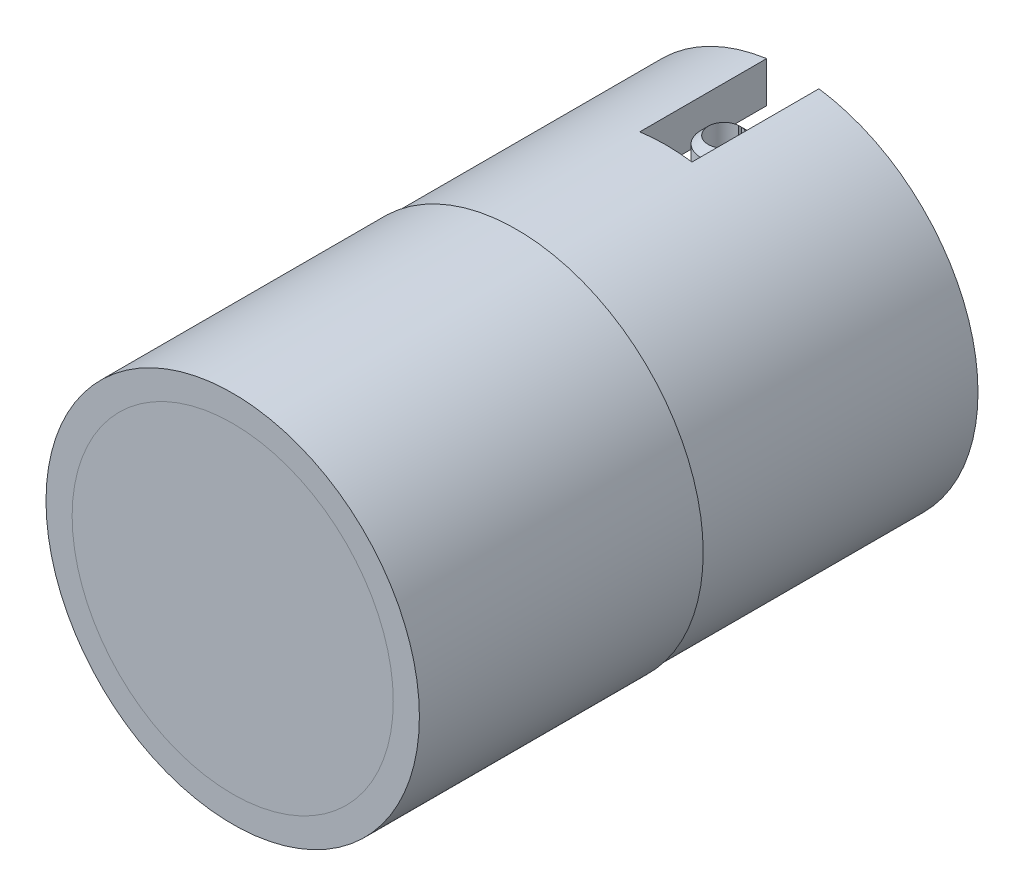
ISO-10303-21;
HEADER;
FILE_DESCRIPTION(('STEP AP214'),'2;1');
FILE_NAME('part.step','',(''),(''),'','','');
FILE_SCHEMA(('AUTOMOTIVE_DESIGN { 1 0 10303 214 1 1 1 1 }'));
ENDSEC;
DATA;
#1=APPLICATION_CONTEXT('core data for automotive mechanical design processes');
#2=APPLICATION_PROTOCOL_DEFINITION('international standard','automotive_design',2000,#1);
#3=PRODUCT_CONTEXT('',#1,'mechanical');
#4=PRODUCT('Part','Part','',(#3));
#5=PRODUCT_RELATED_PRODUCT_CATEGORY('part','',(#4));
#6=PRODUCT_DEFINITION_FORMATION('','',#4);
#7=PRODUCT_DEFINITION_CONTEXT('part definition',#1,'design');
#8=PRODUCT_DEFINITION('design','',#6,#7);
#9=PRODUCT_DEFINITION_SHAPE('','',#8);
#10=(LENGTH_UNIT() NAMED_UNIT(*) SI_UNIT(.MILLI.,.METRE.));
#11=(NAMED_UNIT(*) PLANE_ANGLE_UNIT() SI_UNIT($,.RADIAN.));
#12=(NAMED_UNIT(*) SI_UNIT($,.STERADIAN.) SOLID_ANGLE_UNIT());
#13=UNCERTAINTY_MEASURE_WITH_UNIT(LENGTH_MEASURE(1.E-05),#10,'distance_accuracy_value','');
#14=(GEOMETRIC_REPRESENTATION_CONTEXT(3) GLOBAL_UNCERTAINTY_ASSIGNED_CONTEXT((#13)) GLOBAL_UNIT_ASSIGNED_CONTEXT((#10,
#11,#12)) REPRESENTATION_CONTEXT('',''));
#15=CARTESIAN_POINT('',(0.,0.,0.));
#16=DIRECTION('',(0.,0.,1.));
#17=DIRECTION('',(1.,0.,0.));
#18=AXIS2_PLACEMENT_3D('',#15,#16,#17);
#19=CARTESIAN_POINT('',(0.,3.1496,-9.525));
#20=DIRECTION('',(0.,0.,1.));
#21=DIRECTION('',(1.,0.,0.));
#22=AXIS2_PLACEMENT_3D('',#19,#20,#21);
#23=PLANE('',#22);
#24=CARTESIAN_POINT('',(0.,0.,-9.525));
#25=DIRECTION('',(0.,0.,1.));
#26=DIRECTION('',(1.,0.,0.));
#27=AXIS2_PLACEMENT_3D('',#24,#25,#26);
#28=CIRCLE('',#27,3.1496);
#29=CARTESIAN_POINT('',(0.444499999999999,-3.11807631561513,-9.525));
#30=VERTEX_POINT('',#29);
#31=CARTESIAN_POINT('',(0.444499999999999,3.11807631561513,-9.525));
#32=VERTEX_POINT('',#31);
#33=EDGE_CURVE('P0_E146',#30,#32,#28,.T.);
#34=ORIENTED_EDGE('',*,*,#33,.F.);
#35=DIRECTION('',(0.,1.,0.));
#36=VECTOR('',#35,1.);
#37=CARTESIAN_POINT('',(0.444499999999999,3.1496,-9.525));
#38=LINE('',#37,#36);
#39=CARTESIAN_POINT('',(0.444499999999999,-2.42337165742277,-9.525));
#40=VERTEX_POINT('',#39);
#41=EDGE_CURVE('P0_E115',#30,#40,#38,.T.);
#42=ORIENTED_EDGE('',*,*,#41,.T.);
#43=CARTESIAN_POINT('',(0.,0.,-9.525));
#44=DIRECTION('',(0.,0.,-1.));
#45=DIRECTION('',(-1.,0.,0.));
#46=AXIS2_PLACEMENT_3D('',#43,#44,#45);
#47=CIRCLE('',#46,2.4638);
#48=CARTESIAN_POINT('',(0.444499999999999,2.42337165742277,-9.525));
#49=VERTEX_POINT('',#48);
#50=EDGE_CURVE('P0_E125',#49,#40,#47,.T.);
#51=ORIENTED_EDGE('',*,*,#50,.F.);
#52=EDGE_CURVE('P0_E111',#49,#32,#38,.T.);
#53=ORIENTED_EDGE('',*,*,#52,.T.);
#54=EDGE_LOOP('',(#34,#42,#51,#53));
#55=FACE_BOUND('',#54,.T.);
#56=ADVANCED_FACE('P0_F16',(#55),#23,.F.);
#57=CARTESIAN_POINT('',(0.,0.,0.));
#58=DIRECTION('',(0.,0.,-1.));
#59=DIRECTION('',(-1.,0.,0.));
#60=AXIS2_PLACEMENT_3D('',#57,#58,#59);
#61=CYLINDRICAL_SURFACE('',#60,1.1938);
#62=CARTESIAN_POINT('',(0.,0.,-1.99797045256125));
#63=DIRECTION('',(0.,0.,1.));
#64=DIRECTION('',(1.,0.,0.));
#65=AXIS2_PLACEMENT_3D('',#62,#63,#64);
#66=CIRCLE('',#65,1.1938);
#67=CARTESIAN_POINT('',(-1.1938,0.,-1.99797045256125));
#68=VERTEX_POINT('',#67);
#69=EDGE_CURVE('P0_E131',#68,#68,#66,.T.);
#70=CARTESIAN_POINT('',(0.,0.,-2.794));
#71=DIRECTION('',(0.,0.,-1.));
#72=DIRECTION('',(-1.,0.,0.));
#73=AXIS2_PLACEMENT_3D('',#70,#71,#72);
#74=CIRCLE('',#73,1.1938);
#75=CARTESIAN_POINT('',(-1.1938,0.,-2.794));
#76=VERTEX_POINT('',#75);
#77=EDGE_CURVE('P0_E124',#76,#76,#74,.F.);
#78=CARTESIAN_POINT('',(-1.1938,0.,-1.99797045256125));
#79=CARTESIAN_POINT('',(-1.1938,0.,-2.00626242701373));
#80=CARTESIAN_POINT('',(-1.1938,0.,-2.01455440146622));
#81=CARTESIAN_POINT('',(-1.1938,0.,-2.03113835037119));
#82=CARTESIAN_POINT('',(-1.1938,0.,-2.03943032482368));
#83=CARTESIAN_POINT('',(-1.1938,0.,-2.05601427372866));
#84=CARTESIAN_POINT('',(-1.1938,0.,-2.06430624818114));
#85=CARTESIAN_POINT('',(-1.1938,0.,-2.08089019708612));
#86=CARTESIAN_POINT('',(-1.1938,0.,-2.0891821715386));
#87=CARTESIAN_POINT('',(-1.1938,0.,-2.10576612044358));
#88=CARTESIAN_POINT('',(-1.1938,0.,-2.11405809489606));
#89=CARTESIAN_POINT('',(-1.1938,0.,-2.13064204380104));
#90=CARTESIAN_POINT('',(-1.1938,0.,-2.13893401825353));
#91=CARTESIAN_POINT('',(-1.1938,0.,-2.1555179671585));
#92=CARTESIAN_POINT('',(-1.1938,0.,-2.16380994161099));
#93=CARTESIAN_POINT('',(-1.1938,0.,-2.18039389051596));
#94=CARTESIAN_POINT('',(-1.1938,0.,-2.18868586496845));
#95=CARTESIAN_POINT('',(-1.1938,0.,-2.20526981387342));
#96=CARTESIAN_POINT('',(-1.1938,0.,-2.21356178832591));
#97=CARTESIAN_POINT('',(-1.1938,0.,-2.23014573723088));
#98=CARTESIAN_POINT('',(-1.1938,0.,-2.23843771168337));
#99=CARTESIAN_POINT('',(-1.1938,0.,-2.25502166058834));
#100=CARTESIAN_POINT('',(-1.1938,0.,-2.26331363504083));
#101=CARTESIAN_POINT('',(-1.1938,0.,-2.27989758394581));
#102=CARTESIAN_POINT('',(-1.1938,0.,-2.28818955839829));
#103=CARTESIAN_POINT('',(-1.1938,0.,-2.30477350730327));
#104=CARTESIAN_POINT('',(-1.1938,0.,-2.31306548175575));
#105=CARTESIAN_POINT('',(-1.1938,0.,-2.32964943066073));
#106=CARTESIAN_POINT('',(-1.1938,0.,-2.33794140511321));
#107=CARTESIAN_POINT('',(-1.1938,0.,-2.35452535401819));
#108=CARTESIAN_POINT('',(-1.1938,0.,-2.36281732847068));
#109=CARTESIAN_POINT('',(-1.1938,0.,-2.37940127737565));
#110=CARTESIAN_POINT('',(-1.1938,0.,-2.38769325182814));
#111=CARTESIAN_POINT('',(-1.1938,0.,-2.40427720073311));
#112=CARTESIAN_POINT('',(-1.1938,0.,-2.4125691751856));
#113=CARTESIAN_POINT('',(-1.1938,0.,-2.42915312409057));
#114=CARTESIAN_POINT('',(-1.1938,0.,-2.43744509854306));
#115=CARTESIAN_POINT('',(-1.1938,0.,-2.45402904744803));
#116=CARTESIAN_POINT('',(-1.1938,0.,-2.46232102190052));
#117=CARTESIAN_POINT('',(-1.1938,0.,-2.47890497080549));
#118=CARTESIAN_POINT('',(-1.1938,0.,-2.48719694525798));
#119=CARTESIAN_POINT('',(-1.1938,0.,-2.50378089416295));
#120=CARTESIAN_POINT('',(-1.1938,0.,-2.51207286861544));
#121=CARTESIAN_POINT('',(-1.1938,0.,-2.52865681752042));
#122=CARTESIAN_POINT('',(-1.1938,0.,-2.5369487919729));
#123=CARTESIAN_POINT('',(-1.1938,0.,-2.55353274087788));
#124=CARTESIAN_POINT('',(-1.1938,0.,-2.56182471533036));
#125=CARTESIAN_POINT('',(-1.1938,0.,-2.57840866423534));
#126=CARTESIAN_POINT('',(-1.1938,0.,-2.58670063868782));
#127=CARTESIAN_POINT('',(-1.1938,0.,-2.6032845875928));
#128=CARTESIAN_POINT('',(-1.1938,0.,-2.61157656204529));
#129=CARTESIAN_POINT('',(-1.1938,0.,-2.62816051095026));
#130=CARTESIAN_POINT('',(-1.1938,0.,-2.63645248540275));
#131=CARTESIAN_POINT('',(-1.1938,0.,-2.65303643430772));
#132=CARTESIAN_POINT('',(-1.1938,0.,-2.66132840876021));
#133=CARTESIAN_POINT('',(-1.1938,0.,-2.67791235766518));
#134=CARTESIAN_POINT('',(-1.1938,0.,-2.68620433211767));
#135=CARTESIAN_POINT('',(-1.1938,0.,-2.70278828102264));
#136=CARTESIAN_POINT('',(-1.1938,0.,-2.71108025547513));
#137=CARTESIAN_POINT('',(-1.1938,0.,-2.7276642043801));
#138=CARTESIAN_POINT('',(-1.1938,0.,-2.73595617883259));
#139=CARTESIAN_POINT('',(-1.1938,0.,-2.75254012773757));
#140=CARTESIAN_POINT('',(-1.1938,0.,-2.76083210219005));
#141=CARTESIAN_POINT('',(-1.1938,0.,-2.77741605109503));
#142=CARTESIAN_POINT('',(-1.1938,0.,-2.78570802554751));
#143=CARTESIAN_POINT('',(-1.1938,0.,-2.794));
#144=B_SPLINE_CURVE_WITH_KNOTS('',3,(#78,#79,#80,#81,#82,#83,#84,#85,#86,#87,#88,#89,#90,#91,
#92,#93,#94,#95,#96,#97,#98,#99,#100,#101,#102,#103,#104,#105,#106,#107,#108,#109,#110,#111,
#112,#113,#114,#115,#116,#117,#118,#119,#120,#121,#122,#123,#124,#125,#126,#127,#128,#129,#130,
#131,#132,#133,#134,#135,#136,#137,#138,#139,#140,#141,#142,#143),.UNSPECIFIED.,.F.,.F.,(4,2,2,
2,2,2,2,2,2,2,2,2,2,2,2,2,2,2,2,2,2,2,2,2,2,2,2,2,2,2,2,2,4),(0.,0.024875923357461,
0.0497518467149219,0.0746277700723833,0.0995036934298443,0.124379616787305,0.149255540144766,
0.174131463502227,0.199007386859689,0.22388331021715,0.24875923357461,0.273635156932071,
0.298511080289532,0.323387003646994,0.348262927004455,0.373138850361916,0.398014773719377,
0.422890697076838,0.447766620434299,0.47264254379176,0.497518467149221,0.522394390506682,
0.547270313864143,0.572146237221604,0.597022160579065,0.621898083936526,0.646774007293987,
0.671649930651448,0.696525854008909,0.72140177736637,0.746277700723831,0.771153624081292,
0.796029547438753),.UNSPECIFIED.);
#145=EDGE_CURVE('P0_BSEAM192',#68,#76,#144,.T.);
#146=ORIENTED_EDGE('',*,*,#69,.T.);
#147=ORIENTED_EDGE('',*,*,#77,.F.);
#148=ORIENTED_EDGE('',*,*,#145,.T.);
#149=ORIENTED_EDGE('',*,*,#145,.F.);
#150=EDGE_LOOP('',(#146,#148,#147,#149));
#151=FACE_BOUND('',#150,.T.);
#152=ADVANCED_FACE('P0_F192',(#151),#61,.F.);
#153=CARTESIAN_POINT('',(0.,0.,0.));
#154=DIRECTION('',(0.,0.,1.));
#155=DIRECTION('',(1.,0.,0.));
#156=AXIS2_PLACEMENT_3D('',#153,#154,#155);
#157=CYLINDRICAL_SURFACE('',#156,3.175);
#158=CARTESIAN_POINT('',(0.,0.,0.));
#159=DIRECTION('',(0.,0.,1.));
#160=DIRECTION('',(1.,0.,0.));
#161=AXIS2_PLACEMENT_3D('',#158,#159,#160);
#162=CIRCLE('',#161,3.175);
#163=CARTESIAN_POINT('',(3.175,0.,0.));
#164=VERTEX_POINT('',#163);
#165=EDGE_CURVE('P0_E137',#164,#164,#162,.T.);
#166=ORIENTED_EDGE('',*,*,#165,.F.);
#167=EDGE_LOOP('',(#166));
#168=FACE_BOUND('',#167,.T.);
#169=CARTESIAN_POINT('',(0.,0.,-4.826));
#170=DIRECTION('',(0.,0.,1.));
#171=DIRECTION('',(1.,0.,0.));
#172=AXIS2_PLACEMENT_3D('',#169,#170,#171);
#173=CIRCLE('',#172,3.175);
#174=CARTESIAN_POINT('',(3.175,0.,-4.826));
#175=VERTEX_POINT('',#174);
#176=EDGE_CURVE('P0_E152',#175,#175,#173,.T.);
#177=ORIENTED_EDGE('',*,*,#176,.T.);
#178=EDGE_LOOP('',(#177));
#179=FACE_BOUND('',#178,.T.);
#180=ADVANCED_FACE('P0_F18',(#168,#179),#157,.T.);
#181=CARTESIAN_POINT('',(0.,3.175,-4.826));
#182=DIRECTION('',(0.,0.,1.));
#183=DIRECTION('',(1.,0.,0.));
#184=AXIS2_PLACEMENT_3D('',#181,#182,#183);
#185=PLANE('',#184);
#186=ORIENTED_EDGE('',*,*,#176,.F.);
#187=EDGE_LOOP('',(#186));
#188=FACE_BOUND('',#187,.T.);
#189=CARTESIAN_POINT('',(0.,0.,-4.826));
#190=DIRECTION('',(0.,0.,1.));
#191=DIRECTION('',(1.,0.,0.));
#192=AXIS2_PLACEMENT_3D('',#189,#190,#191);
#193=CIRCLE('',#192,3.1496);
#194=CARTESIAN_POINT('',(3.1496,0.,-4.826));
#195=VERTEX_POINT('',#194);
#196=EDGE_CURVE('P0_E149',#195,#195,#193,.T.);
#197=ORIENTED_EDGE('',*,*,#196,.T.);
#198=EDGE_LOOP('',(#197));
#199=FACE_BOUND('',#198,.T.);
#200=ADVANCED_FACE('P0_F211',(#188,#199),#185,.F.);
#201=CARTESIAN_POINT('',(0.,0.,0.));
#202=DIRECTION('',(0.,0.,1.));
#203=DIRECTION('',(1.,0.,0.));
#204=AXIS2_PLACEMENT_3D('',#201,#202,#203);
#205=CYLINDRICAL_SURFACE('',#204,3.1496);
#206=ORIENTED_EDGE('',*,*,#196,.F.);
#207=EDGE_LOOP('',(#206));
#208=FACE_BOUND('',#207,.T.);
#209=CARTESIAN_POINT('',(0.,0.,-7.366));
#210=DIRECTION('',(0.,0.,1.));
#211=DIRECTION('',(1.,0.,0.));
#212=AXIS2_PLACEMENT_3D('',#209,#210,#211);
#213=CIRCLE('',#212,3.1496);
#214=CARTESIAN_POINT('',(-0.444500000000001,-3.11807631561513,-7.366));
#215=VERTEX_POINT('',#214);
#216=CARTESIAN_POINT('',(0.444499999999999,-3.11807631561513,-7.366));
#217=VERTEX_POINT('',#216);
#218=EDGE_CURVE('P0_E82',#215,#217,#213,.T.);
#219=ORIENTED_EDGE('',*,*,#218,.T.);
#220=DIRECTION('',(0.,0.,1.));
#221=VECTOR('',#220,1.);
#222=CARTESIAN_POINT('',(0.444499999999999,-3.11807631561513,0.));
#223=LINE('',#222,#221);
#224=EDGE_CURVE('P0_E118',#217,#30,#223,.F.);
#225=ORIENTED_EDGE('',*,*,#224,.T.);
#226=ORIENTED_EDGE('',*,*,#33,.T.);
#227=DIRECTION('',(0.,0.,1.));
#228=VECTOR('',#227,1.);
#229=CARTESIAN_POINT('',(0.444499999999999,3.11807631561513,0.));
#230=LINE('',#229,#228);
#231=CARTESIAN_POINT('',(0.444499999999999,3.11807631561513,-7.366));
#232=VERTEX_POINT('',#231);
#233=EDGE_CURVE('P0_E114',#32,#232,#230,.T.);
#234=ORIENTED_EDGE('',*,*,#233,.T.);
#235=CARTESIAN_POINT('',(-0.444500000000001,3.11807631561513,-7.366));
#236=VERTEX_POINT('',#235);
#237=EDGE_CURVE('P0_E92',#232,#236,#213,.T.);
#238=ORIENTED_EDGE('',*,*,#237,.T.);
#239=DIRECTION('',(0.,0.,1.));
#240=VECTOR('',#239,1.);
#241=CARTESIAN_POINT('',(-0.444500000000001,3.11807631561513,0.));
#242=LINE('',#241,#240);
#243=CARTESIAN_POINT('',(-0.444500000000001,3.11807631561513,-9.525));
#244=VERTEX_POINT('',#243);
#245=EDGE_CURVE('P0_E93',#236,#244,#242,.F.);
#246=ORIENTED_EDGE('',*,*,#245,.T.);
#247=CARTESIAN_POINT('',(-0.444500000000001,-3.11807631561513,-9.525));
#248=VERTEX_POINT('',#247);
#249=EDGE_CURVE('P0_E104',#244,#248,#28,.T.);
#250=ORIENTED_EDGE('',*,*,#249,.T.);
#251=DIRECTION('',(0.,0.,1.));
#252=VECTOR('',#251,1.);
#253=CARTESIAN_POINT('',(-0.444500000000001,-3.11807631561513,0.));
#254=LINE('',#253,#252);
#255=EDGE_CURVE('P0_E96',#248,#215,#254,.T.);
#256=ORIENTED_EDGE('',*,*,#255,.T.);
#257=EDGE_LOOP('',(#219,#225,#226,#234,#238,#246,#250,#256));
#258=FACE_BOUND('',#257,.T.);
#259=ADVANCED_FACE('P0_F101',(#208,#258),#205,.T.);
#260=ORIENTED_EDGE('',*,*,#249,.F.);
#261=DIRECTION('',(0.,-1.,0.));
#262=VECTOR('',#261,1.);
#263=CARTESIAN_POINT('',(-0.444500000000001,3.1496,-9.525));
#264=LINE('',#263,#262);
#265=CARTESIAN_POINT('',(-0.444500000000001,2.42337165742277,-9.525));
#266=VERTEX_POINT('',#265);
#267=EDGE_CURVE('P0_E105',#244,#266,#264,.T.);
#268=ORIENTED_EDGE('',*,*,#267,.T.);
#269=CARTESIAN_POINT('',(-0.444500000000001,-2.42337165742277,-9.525));
#270=VERTEX_POINT('',#269);
#271=EDGE_CURVE('P0_E120',#270,#266,#47,.T.);
#272=ORIENTED_EDGE('',*,*,#271,.F.);
#273=EDGE_CURVE('P0_E39',#270,#248,#264,.T.);
#274=ORIENTED_EDGE('',*,*,#273,.T.);
#275=EDGE_LOOP('',(#260,#268,#272,#274));
#276=FACE_BOUND('',#275,.T.);
#277=ADVANCED_FACE('P0_F194',(#276),#23,.F.);
#278=CARTESIAN_POINT('',(0.,2.32214543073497,-1.524));
#279=DIRECTION('',(0.,0.,-1.));
#280=DIRECTION('',(-1.,0.,0.));
#281=AXIS2_PLACEMENT_3D('',#278,#279,#280);
#282=PLANE('',#281);
#283=CARTESIAN_POINT('',(0.,0.,-1.524));
#284=DIRECTION('',(0.,0.,1.));
#285=DIRECTION('',(1.,0.,0.));
#286=AXIS2_PLACEMENT_3D('',#283,#284,#285);
#287=CIRCLE('',#286,1.5748);
#288=CARTESIAN_POINT('',(1.5748,0.,-1.524));
#289=VERTEX_POINT('',#288);
#290=EDGE_CURVE('P0_E134',#289,#289,#287,.T.);
#291=ORIENTED_EDGE('',*,*,#290,.F.);
#292=EDGE_LOOP('',(#291));
#293=FACE_BOUND('',#292,.T.);
#294=CARTESIAN_POINT('',(0.,0.,-1.524));
#295=DIRECTION('',(0.,0.,1.));
#296=DIRECTION('',(1.,0.,0.));
#297=AXIS2_PLACEMENT_3D('',#294,#295,#296);
#298=CIRCLE('',#297,2.32214543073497);
#299=CARTESIAN_POINT('',(2.32214543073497,0.,-1.524));
#300=VERTEX_POINT('',#299);
#301=EDGE_CURVE('P0_E143',#300,#300,#298,.T.);
#302=ORIENTED_EDGE('',*,*,#301,.T.);
#303=EDGE_LOOP('',(#302));
#304=FACE_BOUND('',#303,.T.);
#305=ADVANCED_FACE('P0_F203',(#293,#304),#282,.F.);
#306=CARTESIAN_POINT('',(0.,0.,0.));
#307=DIRECTION('',(0.,0.,1.));
#308=DIRECTION('',(1.,0.,0.));
#309=AXIS2_PLACEMENT_3D('',#306,#307,#308);
#310=CONICAL_SURFACE('',#309,2.7305,0.26179938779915);
#311=ORIENTED_EDGE('',*,*,#301,.F.);
#312=EDGE_LOOP('',(#311));
#313=FACE_BOUND('',#312,.T.);
#314=CARTESIAN_POINT('',(0.,0.,0.));
#315=DIRECTION('',(0.,0.,1.));
#316=DIRECTION('',(1.,0.,0.));
#317=AXIS2_PLACEMENT_3D('',#314,#315,#316);
#318=CIRCLE('',#317,2.7305);
#319=CARTESIAN_POINT('',(2.7305,0.,0.));
#320=VERTEX_POINT('',#319);
#321=EDGE_CURVE('P0_E140',#320,#320,#318,.T.);
#322=ORIENTED_EDGE('',*,*,#321,.T.);
#323=EDGE_LOOP('',(#322));
#324=FACE_BOUND('',#323,.T.);
#325=ADVANCED_FACE('P0_F209',(#313,#324),#310,.F.);
#326=CARTESIAN_POINT('',(0.,2.7305,0.));
#327=DIRECTION('',(0.,0.,-1.));
#328=DIRECTION('',(-1.,0.,0.));
#329=AXIS2_PLACEMENT_3D('',#326,#327,#328);
#330=PLANE('',#329);
#331=ORIENTED_EDGE('',*,*,#321,.F.);
#332=EDGE_LOOP('',(#331));
#333=FACE_BOUND('',#332,.T.);
#334=ORIENTED_EDGE('',*,*,#165,.T.);
#335=EDGE_LOOP('',(#334));
#336=FACE_BOUND('',#335,.T.);
#337=ADVANCED_FACE('P0_F239',(#333,#336),#330,.F.);
#338=CARTESIAN_POINT('',(0.,0.,-1.778));
#339=DIRECTION('',(0.,0.,1.));
#340=DIRECTION('',(1.,0.,0.));
#341=AXIS2_PLACEMENT_3D('',#338,#339,#340);
#342=CYLINDRICAL_SURFACE('',#341,1.5748);
#343=CARTESIAN_POINT('',(0.,0.,-1.778));
#344=DIRECTION('',(0.,0.,1.));
#345=DIRECTION('',(1.,0.,0.));
#346=AXIS2_PLACEMENT_3D('',#343,#344,#345);
#347=CIRCLE('',#346,1.5748);
#348=CARTESIAN_POINT('',(1.5748,0.,-1.778));
#349=VERTEX_POINT('',#348);
#350=EDGE_CURVE('P0_E128',#349,#349,#347,.T.);
#351=ORIENTED_EDGE('',*,*,#350,.F.);
#352=EDGE_LOOP('',(#351));
#353=FACE_BOUND('',#352,.T.);
#354=ORIENTED_EDGE('',*,*,#290,.T.);
#355=EDGE_LOOP('',(#354));
#356=FACE_BOUND('',#355,.T.);
#357=ADVANCED_FACE('P0_F236',(#353,#356),#342,.F.);
#358=CARTESIAN_POINT('',(0.,0.,-1.778));
#359=DIRECTION('',(0.,0.,1.));
#360=DIRECTION('',(1.,0.,0.));
#361=AXIS2_PLACEMENT_3D('',#358,#359,#360);
#362=CONICAL_SURFACE('',#361,1.5748,1.0471975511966);
#363=ORIENTED_EDGE('',*,*,#350,.T.);
#364=EDGE_LOOP('',(#363));
#365=FACE_BOUND('',#364,.T.);
#366=ORIENTED_EDGE('',*,*,#69,.F.);
#367=EDGE_LOOP('',(#366));
#368=FACE_BOUND('',#367,.T.);
#369=ADVANCED_FACE('P0_F230',(#365,#368),#362,.F.);
#370=CARTESIAN_POINT('',(0.,0.,-2.794));
#371=DIRECTION('',(0.,0.,-1.));
#372=DIRECTION('',(-1.,0.,0.));
#373=AXIS2_PLACEMENT_3D('',#370,#371,#372);
#374=PLANE('',#373);
#375=CARTESIAN_POINT('',(0.,0.,-2.794));
#376=DIRECTION('',(0.,0.,-1.));
#377=DIRECTION('',(-1.,0.,0.));
#378=AXIS2_PLACEMENT_3D('',#375,#376,#377);
#379=CIRCLE('',#378,2.4638);
#380=CARTESIAN_POINT('',(-2.4638,0.,-2.794));
#381=VERTEX_POINT('',#380);
#382=EDGE_CURVE('P0_E121',#381,#381,#379,.T.);
#383=ORIENTED_EDGE('',*,*,#382,.T.);
#384=EDGE_LOOP('',(#383));
#385=FACE_BOUND('',#384,.T.);
#386=ORIENTED_EDGE('',*,*,#77,.T.);
#387=EDGE_LOOP('',(#386));
#388=FACE_BOUND('',#387,.T.);
#389=ADVANCED_FACE('P0_F224',(#385,#388),#374,.T.);
#390=CARTESIAN_POINT('',(0.,0.,-2.794));
#391=DIRECTION('',(0.,0.,-1.));
#392=DIRECTION('',(-1.,0.,0.));
#393=AXIS2_PLACEMENT_3D('',#390,#391,#392);
#394=CYLINDRICAL_SURFACE('',#393,2.4638);
#395=ORIENTED_EDGE('',*,*,#382,.F.);
#396=EDGE_LOOP('',(#395));
#397=FACE_BOUND('',#396,.T.);
#398=CARTESIAN_POINT('',(0.,0.,-7.366));
#399=DIRECTION('',(0.,0.,1.));
#400=DIRECTION('',(1.,0.,0.));
#401=AXIS2_PLACEMENT_3D('',#398,#399,#400);
#402=CIRCLE('',#401,2.4638);
#403=CARTESIAN_POINT('',(-0.444500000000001,2.42337165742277,-7.366));
#404=VERTEX_POINT('',#403);
#405=CARTESIAN_POINT('',(0.444499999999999,2.42337165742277,-7.366));
#406=VERTEX_POINT('',#405);
#407=EDGE_CURVE('P0_E24',#404,#406,#402,.F.);
#408=ORIENTED_EDGE('',*,*,#407,.T.);
#409=DIRECTION('',(0.,0.,-1.));
#410=VECTOR('',#409,1.);
#411=CARTESIAN_POINT('',(0.444499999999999,2.42337165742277,-2.794));
#412=LINE('',#411,#410);
#413=EDGE_CURVE('P0_E10',#406,#49,#412,.T.);
#414=ORIENTED_EDGE('',*,*,#413,.T.);
#415=ORIENTED_EDGE('',*,*,#50,.T.);
#416=DIRECTION('',(0.,0.,-1.));
#417=VECTOR('',#416,1.);
#418=CARTESIAN_POINT('',(0.444499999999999,-2.42337165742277,-2.794));
#419=LINE('',#418,#417);
#420=CARTESIAN_POINT('',(0.444499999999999,-2.42337165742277,-7.366));
#421=VERTEX_POINT('',#420);
#422=EDGE_CURVE('P0_E160',#40,#421,#419,.F.);
#423=ORIENTED_EDGE('',*,*,#422,.T.);
#424=CARTESIAN_POINT('',(-0.444500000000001,-2.42337165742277,-7.366));
#425=VERTEX_POINT('',#424);
#426=EDGE_CURVE('P0_E158',#421,#425,#402,.F.);
#427=ORIENTED_EDGE('',*,*,#426,.T.);
#428=DIRECTION('',(0.,0.,-1.));
#429=VECTOR('',#428,1.);
#430=CARTESIAN_POINT('',(-0.444500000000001,-2.42337165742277,-2.794));
#431=LINE('',#430,#429);
#432=EDGE_CURVE('P0_E97',#425,#270,#431,.T.);
#433=ORIENTED_EDGE('',*,*,#432,.T.);
#434=ORIENTED_EDGE('',*,*,#271,.T.);
#435=DIRECTION('',(0.,0.,-1.));
#436=VECTOR('',#435,1.);
#437=CARTESIAN_POINT('',(-0.444500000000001,2.42337165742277,-2.794));
#438=LINE('',#437,#436);
#439=EDGE_CURVE('P0_E162',#266,#404,#438,.F.);
#440=ORIENTED_EDGE('',*,*,#439,.T.);
#441=EDGE_LOOP('',(#408,#414,#415,#423,#427,#433,#434,#440));
#442=FACE_BOUND('',#441,.T.);
#443=ADVANCED_FACE('P0_F166',(#397,#442),#394,.F.);
#444=CARTESIAN_POINT('',(-0.444500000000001,-3.175,-7.366));
#445=DIRECTION('',(-1.,0.,0.));
#446=DIRECTION('',(0.,0.,1.));
#447=AXIS2_PLACEMENT_3D('',#444,#445,#446);
#448=PLANE('',#447);
#449=ORIENTED_EDGE('',*,*,#273,.F.);
#450=ORIENTED_EDGE('',*,*,#432,.F.);
#451=DIRECTION('',(0.,1.,0.));
#452=VECTOR('',#451,1.);
#453=CARTESIAN_POINT('',(-0.444500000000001,-3.175,-7.366));
#454=LINE('',#453,#452);
#455=EDGE_CURVE('P0_E85',#215,#425,#454,.T.);
#456=ORIENTED_EDGE('',*,*,#455,.F.);
#457=ORIENTED_EDGE('',*,*,#255,.F.);
#458=EDGE_LOOP('',(#449,#450,#456,#457));
#459=FACE_BOUND('',#458,.T.);
#460=ADVANCED_FACE('P0_F95',(#459),#448,.F.);
#461=CARTESIAN_POINT('',(0.444499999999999,-3.175,-7.366));
#462=DIRECTION('',(0.,0.,1.));
#463=DIRECTION('',(1.,0.,0.));
#464=AXIS2_PLACEMENT_3D('',#461,#462,#463);
#465=PLANE('',#464);
#466=ORIENTED_EDGE('',*,*,#455,.T.);
#467=ORIENTED_EDGE('',*,*,#426,.F.);
#468=DIRECTION('',(0.,1.,0.));
#469=VECTOR('',#468,1.);
#470=CARTESIAN_POINT('',(0.444499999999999,-3.175,-7.366));
#471=LINE('',#470,#469);
#472=EDGE_CURVE('P0_E88',#217,#421,#471,.T.);
#473=ORIENTED_EDGE('',*,*,#472,.F.);
#474=ORIENTED_EDGE('',*,*,#218,.F.);
#475=EDGE_LOOP('',(#466,#467,#473,#474));
#476=FACE_BOUND('',#475,.T.);
#477=ADVANCED_FACE('P0_F84',(#476),#465,.F.);
#478=CARTESIAN_POINT('',(0.444499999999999,-3.175,-7.7978));
#479=DIRECTION('',(1.,0.,0.));
#480=DIRECTION('',(0.,0.,-1.));
#481=AXIS2_PLACEMENT_3D('',#478,#479,#480);
#482=PLANE('',#481);
#483=ORIENTED_EDGE('',*,*,#472,.T.);
#484=ORIENTED_EDGE('',*,*,#422,.F.);
#485=ORIENTED_EDGE('',*,*,#41,.F.);
#486=ORIENTED_EDGE('',*,*,#224,.F.);
#487=EDGE_LOOP('',(#483,#484,#485,#486));
#488=FACE_BOUND('',#487,.T.);
#489=ADVANCED_FACE('P0_F177',(#488),#482,.F.);
#490=ORIENTED_EDGE('',*,*,#52,.F.);
#491=ORIENTED_EDGE('',*,*,#413,.F.);
#492=EDGE_CURVE('P0_E98',#406,#232,#471,.T.);
#493=ORIENTED_EDGE('',*,*,#492,.T.);
#494=ORIENTED_EDGE('',*,*,#233,.F.);
#495=EDGE_LOOP('',(#490,#491,#493,#494));
#496=FACE_BOUND('',#495,.T.);
#497=ADVANCED_FACE('P0_F181',(#496),#482,.F.);
#498=ORIENTED_EDGE('',*,*,#492,.F.);
#499=ORIENTED_EDGE('',*,*,#407,.F.);
#500=EDGE_CURVE('P0_E31',#404,#236,#454,.T.);
#501=ORIENTED_EDGE('',*,*,#500,.T.);
#502=ORIENTED_EDGE('',*,*,#237,.F.);
#503=EDGE_LOOP('',(#498,#499,#501,#502));
#504=FACE_BOUND('',#503,.T.);
#505=ADVANCED_FACE('P0_F171',(#504),#465,.F.);
#506=ORIENTED_EDGE('',*,*,#500,.F.);
#507=ORIENTED_EDGE('',*,*,#439,.F.);
#508=ORIENTED_EDGE('',*,*,#267,.F.);
#509=ORIENTED_EDGE('',*,*,#245,.F.);
#510=EDGE_LOOP('',(#506,#507,#508,#509));
#511=FACE_BOUND('',#510,.T.);
#512=ADVANCED_FACE('P0_F189',(#511),#448,.F.);
#513=CLOSED_SHELL('',(#56,#152,#180,#200,#259,#277,#305,#325,#337,#357,#369,#389,#443,#460,#477,
#489,#497,#505,#512));
#514=MANIFOLD_SOLID_BREP('P0_B1',#513);
#515=CARTESIAN_POINT('',(0.,2.794,-8.3566));
#516=DIRECTION('',(0.,-1.,0.));
#517=DIRECTION('',(-1.,0.,0.));
#518=AXIS2_PLACEMENT_3D('',#515,#516,#517);
#519=CYLINDRICAL_SURFACE('',#518,0.396875);
#520=DIRECTION('',(0.,-1.,0.));
#521=VECTOR('',#520,1.);
#522=CARTESIAN_POINT('',(-0.0254,2.794,-8.75266136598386));
#523=LINE('',#522,#521);
#524=CARTESIAN_POINT('',(-0.0254,2.667,-8.75266136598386));
#525=VERTEX_POINT('',#524);
#526=CARTESIAN_POINT('',(-0.0254,-2.667,-8.75266136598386));
#527=VERTEX_POINT('',#526);
#528=EDGE_CURVE('P1_E83',#525,#527,#523,.T.);
#529=ORIENTED_EDGE('',*,*,#528,.T.);
#530=CARTESIAN_POINT('',(0.,-2.667,-8.3566));
#531=DIRECTION('',(0.,1.,0.));
#532=DIRECTION('',(1.,0.,0.));
#533=AXIS2_PLACEMENT_3D('',#530,#531,#532);
#534=CIRCLE('',#533,0.396875);
#535=CARTESIAN_POINT('',(0.0254,-2.667,-8.75266136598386));
#536=VERTEX_POINT('',#535);
#537=EDGE_CURVE('P1_E71',#527,#536,#534,.T.);
#538=ORIENTED_EDGE('',*,*,#537,.T.);
#539=DIRECTION('',(0.,-1.,0.));
#540=VECTOR('',#539,1.);
#541=CARTESIAN_POINT('',(0.0254,2.794,-8.75266136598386));
#542=LINE('',#541,#540);
#543=CARTESIAN_POINT('',(0.0254,2.667,-8.75266136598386));
#544=VERTEX_POINT('',#543);
#545=EDGE_CURVE('P1_E78',#544,#536,#542,.T.);
#546=ORIENTED_EDGE('',*,*,#545,.F.);
#547=CARTESIAN_POINT('',(0.,2.667,-8.3566));
#548=DIRECTION('',(0.,1.,0.));
#549=DIRECTION('',(1.,0.,0.));
#550=AXIS2_PLACEMENT_3D('',#547,#548,#549);
#551=CIRCLE('',#550,0.396875);
#552=EDGE_CURVE('P1_E43',#544,#525,#551,.F.);
#553=ORIENTED_EDGE('',*,*,#552,.T.);
#554=EDGE_LOOP('',(#529,#538,#546,#553));
#555=FACE_BOUND('',#554,.T.);
#556=ADVANCED_FACE('P1_F17',(#555),#519,.T.);
#557=CARTESIAN_POINT('',(0.0254,2.794,-8.75266136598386));
#558=DIRECTION('',(1.,0.,0.));
#559=DIRECTION('',(0.,0.,-1.));
#560=AXIS2_PLACEMENT_3D('',#557,#558,#559);
#561=PLANE('',#560);
#562=ORIENTED_EDGE('',*,*,#545,.T.);
#563=CARTESIAN_POINT('',(0.0254,-2.667,-8.75266136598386));
#564=CARTESIAN_POINT('',(0.0254,-2.68817892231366,-8.73144286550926));
#565=CARTESIAN_POINT('',(0.0254,-2.70935171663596,-8.71021825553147));
#566=CARTESIAN_POINT('',(0.0254,-2.75168504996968,-8.66775681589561));
#567=CARTESIAN_POINT('',(0.0254,-2.77284558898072,-8.64651998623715));
#568=CARTESIAN_POINT('',(0.0254,-2.794,-8.62527704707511));
#569=B_SPLINE_CURVE_WITH_KNOTS('',3,(#563,#564,#565,#566,#567,#568),.UNSPECIFIED.,.F.,.F.,(4,2,
4),(0.,0.0899385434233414,0.179877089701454),.UNSPECIFIED.);
#570=CARTESIAN_POINT('',(0.0254,-2.794,-8.62527704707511));
#571=VERTEX_POINT('',#570);
#572=EDGE_CURVE('P1_E70',#536,#571,#569,.T.);
#573=ORIENTED_EDGE('',*,*,#572,.T.);
#574=DIRECTION('',(0.,-1.,0.));
#575=VECTOR('',#574,1.);
#576=CARTESIAN_POINT('',(0.0254,2.794,-8.62527704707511));
#577=LINE('',#576,#575);
#578=CARTESIAN_POINT('',(0.0254,2.794,-8.62527704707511));
#579=VERTEX_POINT('',#578);
#580=EDGE_CURVE('P1_E74',#579,#571,#577,.T.);
#581=ORIENTED_EDGE('',*,*,#580,.F.);
#582=CARTESIAN_POINT('',(0.0254,2.794,-8.62527704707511));
#583=CARTESIAN_POINT('',(0.0254,2.77284558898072,-8.64651998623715));
#584=CARTESIAN_POINT('',(0.0254,2.75168504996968,-8.66775681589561));
#585=CARTESIAN_POINT('',(0.0254,2.70935171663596,-8.71021825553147));
#586=CARTESIAN_POINT('',(0.0254,2.68817892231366,-8.73144286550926));
#587=CARTESIAN_POINT('',(0.0254,2.667,-8.75266136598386));
#588=B_SPLINE_CURVE_WITH_KNOTS('',3,(#582,#583,#584,#585,#586,#587),.UNSPECIFIED.,.F.,.F.,(4,2,
4),(0.,0.0899385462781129,0.179877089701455),.UNSPECIFIED.);
#589=EDGE_CURVE('P1_E63',#579,#544,#588,.T.);
#590=ORIENTED_EDGE('',*,*,#589,.T.);
#591=EDGE_LOOP('',(#562,#573,#581,#590));
#592=FACE_BOUND('',#591,.T.);
#593=ADVANCED_FACE('P1_F75',(#592),#561,.F.);
#594=CARTESIAN_POINT('',(0.,2.794,-8.3566));
#595=DIRECTION('',(0.,-1.,0.));
#596=DIRECTION('',(-1.,0.,0.));
#597=AXIS2_PLACEMENT_3D('',#594,#595,#596);
#598=CYLINDRICAL_SURFACE('',#597,0.269875);
#599=CARTESIAN_POINT('',(0.,-2.794,-8.3566));
#600=DIRECTION('',(0.,-1.,0.));
#601=DIRECTION('',(1.,0.,0.));
#602=AXIS2_PLACEMENT_3D('',#599,#600,#601);
#603=CIRCLE('',#602,0.269875);
#604=CARTESIAN_POINT('',(-0.0254,-2.794,-8.62527704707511));
#605=VERTEX_POINT('',#604);
#606=EDGE_CURVE('P1_E84',#571,#605,#603,.T.);
#607=ORIENTED_EDGE('',*,*,#606,.T.);
#608=DIRECTION('',(0.,-1.,0.));
#609=VECTOR('',#608,1.);
#610=CARTESIAN_POINT('',(-0.0254,2.794,-8.62527704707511));
#611=LINE('',#610,#609);
#612=CARTESIAN_POINT('',(-0.0254,2.794,-8.62527704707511));
#613=VERTEX_POINT('',#612);
#614=EDGE_CURVE('P1_E79',#613,#605,#611,.T.);
#615=ORIENTED_EDGE('',*,*,#614,.F.);
#616=CARTESIAN_POINT('',(0.,2.794,-8.3566));
#617=DIRECTION('',(0.,-1.,0.));
#618=DIRECTION('',(1.,0.,0.));
#619=AXIS2_PLACEMENT_3D('',#616,#617,#618);
#620=CIRCLE('',#619,0.269875);
#621=EDGE_CURVE('P1_E67',#579,#613,#620,.T.);
#622=ORIENTED_EDGE('',*,*,#621,.F.);
#623=ORIENTED_EDGE('',*,*,#580,.T.);
#624=EDGE_LOOP('',(#607,#615,#622,#623));
#625=FACE_BOUND('',#624,.T.);
#626=ADVANCED_FACE('P1_F82',(#625),#598,.F.);
#627=CARTESIAN_POINT('',(-0.0254,2.794,-8.75266136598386));
#628=DIRECTION('',(-1.,0.,0.));
#629=DIRECTION('',(0.,0.,1.));
#630=AXIS2_PLACEMENT_3D('',#627,#628,#629);
#631=PLANE('',#630);
#632=ORIENTED_EDGE('',*,*,#614,.T.);
#633=CARTESIAN_POINT('',(-0.0254,-2.794,-8.62527704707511));
#634=CARTESIAN_POINT('',(-0.0254,-2.77284558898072,-8.64651998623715));
#635=CARTESIAN_POINT('',(-0.0254,-2.75168504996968,-8.66775681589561));
#636=CARTESIAN_POINT('',(-0.0254,-2.70935171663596,-8.71021825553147));
#637=CARTESIAN_POINT('',(-0.0254,-2.68817892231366,-8.73144286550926));
#638=CARTESIAN_POINT('',(-0.0254,-2.667,-8.75266136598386));
#639=B_SPLINE_CURVE_WITH_KNOTS('',3,(#633,#634,#635,#636,#637,#638),.UNSPECIFIED.,.F.,.F.,(4,2,
4),(0.,0.0899385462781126,0.179877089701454),.UNSPECIFIED.);
#640=EDGE_CURVE('P1_E11',#605,#527,#639,.T.);
#641=ORIENTED_EDGE('',*,*,#640,.T.);
#642=ORIENTED_EDGE('',*,*,#528,.F.);
#643=CARTESIAN_POINT('',(-0.0254,2.667,-8.75266136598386));
#644=CARTESIAN_POINT('',(-0.0254,2.68817892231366,-8.73144286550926));
#645=CARTESIAN_POINT('',(-0.0254,2.70935171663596,-8.71021825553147));
#646=CARTESIAN_POINT('',(-0.0254,2.75168504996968,-8.66775681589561));
#647=CARTESIAN_POINT('',(-0.0254,2.77284558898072,-8.64651998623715));
#648=CARTESIAN_POINT('',(-0.0254,2.794,-8.62527704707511));
#649=B_SPLINE_CURVE_WITH_KNOTS('',3,(#643,#644,#645,#646,#647,#648),.UNSPECIFIED.,.F.,.F.,(4,2,
4),(0.,0.0899385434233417,0.179877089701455),.UNSPECIFIED.);
#650=EDGE_CURVE('P1_E31',#525,#613,#649,.T.);
#651=ORIENTED_EDGE('',*,*,#650,.T.);
#652=EDGE_LOOP('',(#632,#641,#642,#651));
#653=FACE_BOUND('',#652,.T.);
#654=ADVANCED_FACE('P1_F112',(#653),#631,.F.);
#655=CARTESIAN_POINT('',(0.,-2.667,-8.3566));
#656=DIRECTION('',(0.,1.,0.));
#657=DIRECTION('',(1.,0.,0.));
#658=AXIS2_PLACEMENT_3D('',#655,#656,#657);
#659=CONICAL_SURFACE('',#658,0.396875,0.785398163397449);
#660=ORIENTED_EDGE('',*,*,#640,.F.);
#661=ORIENTED_EDGE('',*,*,#606,.F.);
#662=ORIENTED_EDGE('',*,*,#572,.F.);
#663=ORIENTED_EDGE('',*,*,#537,.F.);
#664=EDGE_LOOP('',(#660,#661,#662,#663));
#665=FACE_BOUND('',#664,.T.);
#666=ADVANCED_FACE('P1_F109',(#665),#659,.T.);
#667=CARTESIAN_POINT('',(0.,2.794,-8.3566));
#668=DIRECTION('',(0.,-1.,0.));
#669=DIRECTION('',(-1.,0.,0.));
#670=AXIS2_PLACEMENT_3D('',#667,#668,#669);
#671=CONICAL_SURFACE('',#670,0.269875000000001,0.785398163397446);
#672=ORIENTED_EDGE('',*,*,#650,.F.);
#673=ORIENTED_EDGE('',*,*,#552,.F.);
#674=ORIENTED_EDGE('',*,*,#589,.F.);
#675=ORIENTED_EDGE('',*,*,#621,.T.);
#676=EDGE_LOOP('',(#672,#673,#674,#675));
#677=FACE_BOUND('',#676,.T.);
#678=ADVANCED_FACE('P1_F19',(#677),#671,.T.);
#679=CLOSED_SHELL('',(#556,#593,#626,#654,#666,#678));
#680=MANIFOLD_SOLID_BREP('P1_B1',#679);
#681=CARTESIAN_POINT('',(2.1209,0.,-7.5184));
#682=DIRECTION('',(0.,1.,0.));
#683=DIRECTION('',(0.,0.,1.));
#684=AXIS2_PLACEMENT_3D('',#681,#682,#683);
#685=PLANE('',#684);
#686=CARTESIAN_POINT('',(2.1209,0.,-7.5184));
#687=DIRECTION('',(0.,1.,0.));
#688=DIRECTION('',(0.,0.,1.));
#689=AXIS2_PLACEMENT_3D('',#686,#687,#688);
#690=CIRCLE('',#689,0.254);
#691=CARTESIAN_POINT('',(2.1209,0.,-7.2644));
#692=VERTEX_POINT('',#691);
#693=EDGE_CURVE('P2_E24',#692,#692,#690,.T.);
#694=ORIENTED_EDGE('',*,*,#693,.T.);
#695=EDGE_LOOP('',(#694));
#696=FACE_BOUND('',#695,.T.);
#697=ADVANCED_FACE('P2_F17',(#696),#685,.T.);
#698=CARTESIAN_POINT('',(2.1209,-1.1848139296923E-13,-3.048));
#699=DIRECTION('',(0.,1.,0.));
#700=DIRECTION('',(0.,0.,1.));
#701=AXIS2_PLACEMENT_3D('',#698,#699,#700);
#702=PLANE('',#701);
#703=CARTESIAN_POINT('',(2.1209,-1.1848139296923E-13,-3.048));
#704=DIRECTION('',(0.,1.,0.));
#705=DIRECTION('',(0.,0.,1.));
#706=AXIS2_PLACEMENT_3D('',#703,#704,#705);
#707=CIRCLE('',#706,0.254);
#708=CARTESIAN_POINT('',(2.1209,-1.1848139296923E-13,-2.794));
#709=VERTEX_POINT('',#708);
#710=EDGE_CURVE('P2_E11',#709,#709,#707,.T.);
#711=ORIENTED_EDGE('',*,*,#710,.F.);
#712=EDGE_LOOP('',(#711));
#713=FACE_BOUND('',#712,.T.);
#714=ADVANCED_FACE('P2_F33',(#713),#702,.F.);
#715=CARTESIAN_POINT('',(2.1209,0.,-7.2644));
#716=CARTESIAN_POINT('',(2.1209,-1.22450218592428,-7.17126666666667));
#717=CARTESIAN_POINT('',(1.06045,-1.83675327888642,-7.07813333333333));
#718=CARTESIAN_POINT('',(0.,-2.44900437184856,-6.985));
#719=CARTESIAN_POINT('',(-1.06045,-1.83675327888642,-6.89186666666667));
#720=CARTESIAN_POINT('',(-2.1209,-1.22450218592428,-6.79873333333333));
#721=CARTESIAN_POINT('',(-2.1209,0.,-6.7056));
#722=CARTESIAN_POINT('',(-2.1209,1.22450218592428,-6.61246666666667));
#723=CARTESIAN_POINT('',(-1.06045,1.83675327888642,-6.51933333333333));
#724=CARTESIAN_POINT('',(0.,2.44900437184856,-6.4262));
#725=CARTESIAN_POINT('',(1.06045,1.83675327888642,-6.33306666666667));
#726=CARTESIAN_POINT('',(2.1209,1.22450218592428,-6.23993333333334));
#727=CARTESIAN_POINT('',(2.1209,0.,-6.1468));
#728=CARTESIAN_POINT('',(2.1209,-1.22450218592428,-6.05366666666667));
#729=CARTESIAN_POINT('',(1.06045,-1.83675327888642,-5.96053333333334));
#730=CARTESIAN_POINT('',(0.,-2.44900437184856,-5.8674));
#731=CARTESIAN_POINT('',(-1.06045,-1.83675327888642,-5.77426666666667));
#732=CARTESIAN_POINT('',(-2.1209,-1.22450218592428,-5.68113333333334));
#733=CARTESIAN_POINT('',(-2.1209,0.,-5.588));
#734=CARTESIAN_POINT('',(-2.1209,1.22450218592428,-5.49486666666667));
#735=CARTESIAN_POINT('',(-1.06045,1.83675327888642,-5.40173333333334));
#736=CARTESIAN_POINT('',(0.,2.44900437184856,-5.30860000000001));
#737=CARTESIAN_POINT('',(1.06045,1.83675327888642,-5.21546666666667));
#738=CARTESIAN_POINT('',(2.1209,1.22450218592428,-5.12233333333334));
#739=CARTESIAN_POINT('',(2.1209,0.,-5.0292));
#740=CARTESIAN_POINT('',(2.1209,-1.22450218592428,-4.93606666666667));
#741=CARTESIAN_POINT('',(1.06045,-1.83675327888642,-4.84293333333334));
#742=CARTESIAN_POINT('',(0.,-2.44900437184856,-4.74980000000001));
#743=CARTESIAN_POINT('',(-1.06045,-1.83675327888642,-4.65666666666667));
#744=CARTESIAN_POINT('',(-2.1209,-1.22450218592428,-4.56353333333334));
#745=CARTESIAN_POINT('',(-2.1209,0.,-4.47040000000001));
#746=CARTESIAN_POINT('',(-2.1209,1.22450218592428,-4.37726666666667));
#747=CARTESIAN_POINT('',(-1.06045,1.83675327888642,-4.28413333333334));
#748=CARTESIAN_POINT('',(0.,2.44900437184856,-4.19100000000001));
#749=CARTESIAN_POINT('',(1.06045,1.83675327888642,-4.09786666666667));
#750=CARTESIAN_POINT('',(2.1209,1.22450218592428,-4.00473333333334));
#751=CARTESIAN_POINT('',(2.1209,0.,-3.91160000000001));
#752=CARTESIAN_POINT('',(2.1209,-1.22450218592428,-3.81846666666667));
#753=CARTESIAN_POINT('',(1.06045,-1.83675327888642,-3.72533333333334));
#754=CARTESIAN_POINT('',(0.,-2.44900437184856,-3.63220000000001));
#755=CARTESIAN_POINT('',(-1.06045,-1.83675327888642,-3.53906666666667));
#756=CARTESIAN_POINT('',(-2.1209,-1.22450218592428,-3.44593333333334));
#757=CARTESIAN_POINT('',(-2.1209,0.,-3.35280000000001));
#758=CARTESIAN_POINT('',(-2.1209,1.22450218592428,-3.25966666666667));
#759=CARTESIAN_POINT('',(-1.06045,1.83675327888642,-3.16653333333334));
#760=CARTESIAN_POINT('',(0.,2.44900437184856,-3.07340000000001));
#761=CARTESIAN_POINT('',(1.06045,1.83675327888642,-2.98026666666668));
#762=CARTESIAN_POINT('',(2.1209,1.22450218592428,-2.88713333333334));
#763=CARTESIAN_POINT('',(2.1209,0.,-2.79400000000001));
#764=CARTESIAN_POINT('',(2.6289,0.,-7.2644));
#765=CARTESIAN_POINT('',(2.6289,-1.51779612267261,-7.17126666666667));
#766=CARTESIAN_POINT('',(1.31445,-2.27669418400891,-7.07813333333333));
#767=CARTESIAN_POINT('',(0.,-3.03559224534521,-6.985));
#768=CARTESIAN_POINT('',(-1.31445,-2.27669418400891,-6.89186666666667));
#769=CARTESIAN_POINT('',(-2.6289,-1.51779612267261,-6.79873333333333));
#770=CARTESIAN_POINT('',(-2.6289,0.,-6.7056));
#771=CARTESIAN_POINT('',(-2.6289,1.51779612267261,-6.61246666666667));
#772=CARTESIAN_POINT('',(-1.31445,2.27669418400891,-6.51933333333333));
#773=CARTESIAN_POINT('',(0.,3.03559224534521,-6.4262));
#774=CARTESIAN_POINT('',(1.31445,2.27669418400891,-6.33306666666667));
#775=CARTESIAN_POINT('',(2.6289,1.51779612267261,-6.23993333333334));
#776=CARTESIAN_POINT('',(2.6289,0.,-6.1468));
#777=CARTESIAN_POINT('',(2.6289,-1.51779612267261,-6.05366666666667));
#778=CARTESIAN_POINT('',(1.31445,-2.27669418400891,-5.96053333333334));
#779=CARTESIAN_POINT('',(0.,-3.03559224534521,-5.8674));
#780=CARTESIAN_POINT('',(-1.31445,-2.27669418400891,-5.77426666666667));
#781=CARTESIAN_POINT('',(-2.6289,-1.51779612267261,-5.68113333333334));
#782=CARTESIAN_POINT('',(-2.6289,0.,-5.588));
#783=CARTESIAN_POINT('',(-2.6289,1.51779612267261,-5.49486666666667));
#784=CARTESIAN_POINT('',(-1.31445,2.27669418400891,-5.40173333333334));
#785=CARTESIAN_POINT('',(0.,3.03559224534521,-5.3086));
#786=CARTESIAN_POINT('',(1.31445,2.27669418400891,-5.21546666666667));
#787=CARTESIAN_POINT('',(2.6289,1.51779612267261,-5.12233333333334));
#788=CARTESIAN_POINT('',(2.6289,0.,-5.0292));
#789=CARTESIAN_POINT('',(2.6289,-1.51779612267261,-4.93606666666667));
#790=CARTESIAN_POINT('',(1.31445,-2.27669418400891,-4.84293333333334));
#791=CARTESIAN_POINT('',(0.,-3.03559224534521,-4.74980000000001));
#792=CARTESIAN_POINT('',(-1.31445,-2.27669418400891,-4.65666666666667));
#793=CARTESIAN_POINT('',(-2.6289,-1.51779612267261,-4.56353333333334));
#794=CARTESIAN_POINT('',(-2.6289,0.,-4.47040000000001));
#795=CARTESIAN_POINT('',(-2.6289,1.51779612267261,-4.37726666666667));
#796=CARTESIAN_POINT('',(-1.31445,2.27669418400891,-4.28413333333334));
#797=CARTESIAN_POINT('',(0.,3.03559224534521,-4.19100000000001));
#798=CARTESIAN_POINT('',(1.31445,2.27669418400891,-4.09786666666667));
#799=CARTESIAN_POINT('',(2.6289,1.51779612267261,-4.00473333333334));
#800=CARTESIAN_POINT('',(2.6289,0.,-3.91160000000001));
#801=CARTESIAN_POINT('',(2.6289,-1.51779612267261,-3.81846666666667));
#802=CARTESIAN_POINT('',(1.31445,-2.27669418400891,-3.72533333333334));
#803=CARTESIAN_POINT('',(0.,-3.03559224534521,-3.63220000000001));
#804=CARTESIAN_POINT('',(-1.31445,-2.27669418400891,-3.53906666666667));
#805=CARTESIAN_POINT('',(-2.6289,-1.51779612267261,-3.44593333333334));
#806=CARTESIAN_POINT('',(-2.6289,0.,-3.35280000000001));
#807=CARTESIAN_POINT('',(-2.6289,1.51779612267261,-3.25966666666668));
#808=CARTESIAN_POINT('',(-1.31445,2.27669418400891,-3.16653333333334));
#809=CARTESIAN_POINT('',(0.,3.03559224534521,-3.07340000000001));
#810=CARTESIAN_POINT('',(1.31445,2.27669418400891,-2.98026666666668));
#811=CARTESIAN_POINT('',(2.6289,1.51779612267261,-2.88713333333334));
#812=CARTESIAN_POINT('',(2.6289,0.,-2.79400000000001));
#813=CARTESIAN_POINT('',(2.6289,0.,-7.7724));
#814=CARTESIAN_POINT('',(2.6289,-1.51779612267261,-7.67926666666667));
#815=CARTESIAN_POINT('',(1.31445,-2.27669418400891,-7.58613333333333));
#816=CARTESIAN_POINT('',(0.,-3.03559224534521,-7.493));
#817=CARTESIAN_POINT('',(-1.31445,-2.27669418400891,-7.39986666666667));
#818=CARTESIAN_POINT('',(-2.6289,-1.51779612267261,-7.30673333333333));
#819=CARTESIAN_POINT('',(-2.6289,0.,-7.2136));
#820=CARTESIAN_POINT('',(-2.6289,1.51779612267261,-7.12046666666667));
#821=CARTESIAN_POINT('',(-1.31445,2.27669418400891,-7.02733333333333));
#822=CARTESIAN_POINT('',(0.,3.03559224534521,-6.9342));
#823=CARTESIAN_POINT('',(1.31445,2.27669418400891,-6.84106666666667));
#824=CARTESIAN_POINT('',(2.6289,1.51779612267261,-6.74793333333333));
#825=CARTESIAN_POINT('',(2.6289,0.,-6.6548));
#826=CARTESIAN_POINT('',(2.6289,-1.51779612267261,-6.56166666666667));
#827=CARTESIAN_POINT('',(1.31445,-2.27669418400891,-6.46853333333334));
#828=CARTESIAN_POINT('',(0.,-3.03559224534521,-6.3754));
#829=CARTESIAN_POINT('',(-1.31445,-2.27669418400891,-6.28226666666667));
#830=CARTESIAN_POINT('',(-2.6289,-1.51779612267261,-6.18913333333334));
#831=CARTESIAN_POINT('',(-2.6289,0.,-6.096));
#832=CARTESIAN_POINT('',(-2.6289,1.51779612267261,-6.00286666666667));
#833=CARTESIAN_POINT('',(-1.31445,2.27669418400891,-5.90973333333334));
#834=CARTESIAN_POINT('',(0.,3.03559224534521,-5.8166));
#835=CARTESIAN_POINT('',(1.31445,2.27669418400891,-5.72346666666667));
#836=CARTESIAN_POINT('',(2.6289,1.51779612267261,-5.63033333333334));
#837=CARTESIAN_POINT('',(2.6289,0.,-5.5372));
#838=CARTESIAN_POINT('',(2.6289,-1.51779612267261,-5.44406666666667));
#839=CARTESIAN_POINT('',(1.31445,-2.27669418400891,-5.35093333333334));
#840=CARTESIAN_POINT('',(0.,-3.03559224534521,-5.2578));
#841=CARTESIAN_POINT('',(-1.31445,-2.27669418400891,-5.16466666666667));
#842=CARTESIAN_POINT('',(-2.6289,-1.51779612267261,-5.07153333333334));
#843=CARTESIAN_POINT('',(-2.6289,0.,-4.97840000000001));
#844=CARTESIAN_POINT('',(-2.6289,1.51779612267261,-4.88526666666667));
#845=CARTESIAN_POINT('',(-1.31445,2.27669418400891,-4.79213333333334));
#846=CARTESIAN_POINT('',(0.,3.03559224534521,-4.69900000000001));
#847=CARTESIAN_POINT('',(1.31445,2.27669418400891,-4.60586666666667));
#848=CARTESIAN_POINT('',(2.6289,1.51779612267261,-4.51273333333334));
#849=CARTESIAN_POINT('',(2.6289,0.,-4.41960000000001));
#850=CARTESIAN_POINT('',(2.6289,-1.51779612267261,-4.32646666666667));
#851=CARTESIAN_POINT('',(1.31445,-2.27669418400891,-4.23333333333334));
#852=CARTESIAN_POINT('',(0.,-3.03559224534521,-4.14020000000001));
#853=CARTESIAN_POINT('',(-1.31445,-2.27669418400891,-4.04706666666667));
#854=CARTESIAN_POINT('',(-2.6289,-1.51779612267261,-3.95393333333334));
#855=CARTESIAN_POINT('',(-2.6289,0.,-3.86080000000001));
#856=CARTESIAN_POINT('',(-2.6289,1.51779612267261,-3.76766666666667));
#857=CARTESIAN_POINT('',(-1.31445,2.27669418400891,-3.67453333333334));
#858=CARTESIAN_POINT('',(0.,3.03559224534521,-3.58140000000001));
#859=CARTESIAN_POINT('',(1.31445,2.27669418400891,-3.48826666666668));
#860=CARTESIAN_POINT('',(2.6289,1.51779612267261,-3.39513333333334));
#861=CARTESIAN_POINT('',(2.6289,0.,-3.30200000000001));
#862=CARTESIAN_POINT('',(2.1209,0.,-7.7724));
#863=CARTESIAN_POINT('',(2.1209,-1.22450218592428,-7.67926666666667));
#864=CARTESIAN_POINT('',(1.06045,-1.83675327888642,-7.58613333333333));
#865=CARTESIAN_POINT('',(0.,-2.44900437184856,-7.493));
#866=CARTESIAN_POINT('',(-1.06045,-1.83675327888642,-7.39986666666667));
#867=CARTESIAN_POINT('',(-2.1209,-1.22450218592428,-7.30673333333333));
#868=CARTESIAN_POINT('',(-2.1209,0.,-7.2136));
#869=CARTESIAN_POINT('',(-2.1209,1.22450218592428,-7.12046666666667));
#870=CARTESIAN_POINT('',(-1.06045,1.83675327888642,-7.02733333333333));
#871=CARTESIAN_POINT('',(0.,2.44900437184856,-6.9342));
#872=CARTESIAN_POINT('',(1.06045,1.83675327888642,-6.84106666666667));
#873=CARTESIAN_POINT('',(2.1209,1.22450218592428,-6.74793333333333));
#874=CARTESIAN_POINT('',(2.1209,0.,-6.6548));
#875=CARTESIAN_POINT('',(2.1209,-1.22450218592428,-6.56166666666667));
#876=CARTESIAN_POINT('',(1.06045,-1.83675327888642,-6.46853333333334));
#877=CARTESIAN_POINT('',(0.,-2.44900437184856,-6.3754));
#878=CARTESIAN_POINT('',(-1.06045,-1.83675327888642,-6.28226666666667));
#879=CARTESIAN_POINT('',(-2.1209,-1.22450218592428,-6.18913333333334));
#880=CARTESIAN_POINT('',(-2.1209,0.,-6.096));
#881=CARTESIAN_POINT('',(-2.1209,1.22450218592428,-6.00286666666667));
#882=CARTESIAN_POINT('',(-1.06045,1.83675327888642,-5.90973333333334));
#883=CARTESIAN_POINT('',(0.,2.44900437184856,-5.8166));
#884=CARTESIAN_POINT('',(1.06045,1.83675327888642,-5.72346666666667));
#885=CARTESIAN_POINT('',(2.1209,1.22450218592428,-5.63033333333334));
#886=CARTESIAN_POINT('',(2.1209,0.,-5.5372));
#887=CARTESIAN_POINT('',(2.1209,-1.22450218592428,-5.44406666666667));
#888=CARTESIAN_POINT('',(1.06045,-1.83675327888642,-5.35093333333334));
#889=CARTESIAN_POINT('',(0.,-2.44900437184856,-5.2578));
#890=CARTESIAN_POINT('',(-1.06045,-1.83675327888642,-5.16466666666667));
#891=CARTESIAN_POINT('',(-2.1209,-1.22450218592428,-5.07153333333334));
#892=CARTESIAN_POINT('',(-2.1209,0.,-4.97840000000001));
#893=CARTESIAN_POINT('',(-2.1209,1.22450218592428,-4.88526666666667));
#894=CARTESIAN_POINT('',(-1.06045,1.83675327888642,-4.79213333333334));
#895=CARTESIAN_POINT('',(0.,2.44900437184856,-4.69900000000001));
#896=CARTESIAN_POINT('',(1.06045,1.83675327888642,-4.60586666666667));
#897=CARTESIAN_POINT('',(2.1209,1.22450218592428,-4.51273333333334));
#898=CARTESIAN_POINT('',(2.1209,0.,-4.41960000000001));
#899=CARTESIAN_POINT('',(2.1209,-1.22450218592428,-4.32646666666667));
#900=CARTESIAN_POINT('',(1.06045,-1.83675327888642,-4.23333333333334));
#901=CARTESIAN_POINT('',(0.,-2.44900437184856,-4.14020000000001));
#902=CARTESIAN_POINT('',(-1.06045,-1.83675327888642,-4.04706666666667));
#903=CARTESIAN_POINT('',(-2.1209,-1.22450218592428,-3.95393333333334));
#904=CARTESIAN_POINT('',(-2.1209,0.,-3.86080000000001));
#905=CARTESIAN_POINT('',(-2.1209,1.22450218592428,-3.76766666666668));
#906=CARTESIAN_POINT('',(-1.06045,1.83675327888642,-3.67453333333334));
#907=CARTESIAN_POINT('',(0.,2.44900437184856,-3.58140000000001));
#908=CARTESIAN_POINT('',(1.06045,1.83675327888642,-3.48826666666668));
#909=CARTESIAN_POINT('',(2.1209,1.22450218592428,-3.39513333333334));
#910=CARTESIAN_POINT('',(2.1209,0.,-3.30200000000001));
#911=CARTESIAN_POINT('',(1.6129,0.,-7.7724));
#912=CARTESIAN_POINT('',(1.6129,-0.931208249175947,-7.67926666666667));
#913=CARTESIAN_POINT('',(0.80645,-1.39681237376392,-7.58613333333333));
#914=CARTESIAN_POINT('',(0.,-1.86241649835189,-7.493));
#915=CARTESIAN_POINT('',(-0.80645,-1.39681237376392,-7.39986666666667));
#916=CARTESIAN_POINT('',(-1.6129,-0.931208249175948,-7.30673333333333));
#917=CARTESIAN_POINT('',(-1.6129,0.,-7.2136));
#918=CARTESIAN_POINT('',(-1.6129,0.931208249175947,-7.12046666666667));
#919=CARTESIAN_POINT('',(-0.806450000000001,1.39681237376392,-7.02733333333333));
#920=CARTESIAN_POINT('',(0.,1.86241649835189,-6.9342));
#921=CARTESIAN_POINT('',(0.806449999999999,1.39681237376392,-6.84106666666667));
#922=CARTESIAN_POINT('',(1.6129,0.931208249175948,-6.74793333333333));
#923=CARTESIAN_POINT('',(1.6129,0.,-6.6548));
#924=CARTESIAN_POINT('',(1.6129,-0.931208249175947,-6.56166666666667));
#925=CARTESIAN_POINT('',(0.80645,-1.39681237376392,-6.46853333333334));
#926=CARTESIAN_POINT('',(0.,-1.86241649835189,-6.3754));
#927=CARTESIAN_POINT('',(-0.80645,-1.39681237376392,-6.28226666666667));
#928=CARTESIAN_POINT('',(-1.6129,-0.931208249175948,-6.18913333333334));
#929=CARTESIAN_POINT('',(-1.6129,0.,-6.096));
#930=CARTESIAN_POINT('',(-1.6129,0.931208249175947,-6.00286666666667));
#931=CARTESIAN_POINT('',(-0.806450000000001,1.39681237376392,-5.90973333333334));
#932=CARTESIAN_POINT('',(0.,1.86241649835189,-5.8166));
#933=CARTESIAN_POINT('',(0.806449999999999,1.39681237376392,-5.72346666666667));
#934=CARTESIAN_POINT('',(1.6129,0.931208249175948,-5.63033333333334));
#935=CARTESIAN_POINT('',(1.6129,0.,-5.5372));
#936=CARTESIAN_POINT('',(1.6129,-0.931208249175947,-5.44406666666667));
#937=CARTESIAN_POINT('',(0.80645,-1.39681237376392,-5.35093333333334));
#938=CARTESIAN_POINT('',(0.,-1.86241649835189,-5.2578));
#939=CARTESIAN_POINT('',(-0.80645,-1.39681237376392,-5.16466666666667));
#940=CARTESIAN_POINT('',(-1.6129,-0.931208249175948,-5.07153333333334));
#941=CARTESIAN_POINT('',(-1.6129,0.,-4.97840000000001));
#942=CARTESIAN_POINT('',(-1.6129,0.931208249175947,-4.88526666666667));
#943=CARTESIAN_POINT('',(-0.806450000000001,1.39681237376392,-4.79213333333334));
#944=CARTESIAN_POINT('',(0.,1.86241649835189,-4.69900000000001));
#945=CARTESIAN_POINT('',(0.806449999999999,1.39681237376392,-4.60586666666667));
#946=CARTESIAN_POINT('',(1.6129,0.931208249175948,-4.51273333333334));
#947=CARTESIAN_POINT('',(1.6129,0.,-4.41960000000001));
#948=CARTESIAN_POINT('',(1.6129,-0.931208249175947,-4.32646666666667));
#949=CARTESIAN_POINT('',(0.80645,-1.39681237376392,-4.23333333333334));
#950=CARTESIAN_POINT('',(0.,-1.86241649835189,-4.14020000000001));
#951=CARTESIAN_POINT('',(-0.80645,-1.39681237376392,-4.04706666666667));
#952=CARTESIAN_POINT('',(-1.6129,-0.931208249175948,-3.95393333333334));
#953=CARTESIAN_POINT('',(-1.6129,0.,-3.86080000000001));
#954=CARTESIAN_POINT('',(-1.6129,0.931208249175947,-3.76766666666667));
#955=CARTESIAN_POINT('',(-0.806450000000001,1.39681237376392,-3.67453333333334));
#956=CARTESIAN_POINT('',(0.,1.86241649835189,-3.58140000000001));
#957=CARTESIAN_POINT('',(0.806449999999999,1.39681237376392,-3.48826666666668));
#958=CARTESIAN_POINT('',(1.6129,0.931208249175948,-3.39513333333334));
#959=CARTESIAN_POINT('',(1.6129,0.,-3.30200000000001));
#960=CARTESIAN_POINT('',(1.6129,0.,-7.2644));
#961=CARTESIAN_POINT('',(1.6129,-0.931208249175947,-7.17126666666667));
#962=CARTESIAN_POINT('',(0.80645,-1.39681237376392,-7.07813333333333));
#963=CARTESIAN_POINT('',(0.,-1.86241649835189,-6.985));
#964=CARTESIAN_POINT('',(-0.80645,-1.39681237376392,-6.89186666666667));
#965=CARTESIAN_POINT('',(-1.6129,-0.931208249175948,-6.79873333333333));
#966=CARTESIAN_POINT('',(-1.6129,0.,-6.7056));
#967=CARTESIAN_POINT('',(-1.6129,0.931208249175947,-6.61246666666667));
#968=CARTESIAN_POINT('',(-0.806450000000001,1.39681237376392,-6.51933333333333));
#969=CARTESIAN_POINT('',(0.,1.86241649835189,-6.4262));
#970=CARTESIAN_POINT('',(0.806449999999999,1.39681237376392,-6.33306666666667));
#971=CARTESIAN_POINT('',(1.6129,0.931208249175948,-6.23993333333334));
#972=CARTESIAN_POINT('',(1.6129,0.,-6.1468));
#973=CARTESIAN_POINT('',(1.6129,-0.931208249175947,-6.05366666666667));
#974=CARTESIAN_POINT('',(0.80645,-1.39681237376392,-5.96053333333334));
#975=CARTESIAN_POINT('',(0.,-1.86241649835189,-5.8674));
#976=CARTESIAN_POINT('',(-0.80645,-1.39681237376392,-5.77426666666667));
#977=CARTESIAN_POINT('',(-1.6129,-0.931208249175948,-5.68113333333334));
#978=CARTESIAN_POINT('',(-1.6129,0.,-5.588));
#979=CARTESIAN_POINT('',(-1.6129,0.931208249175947,-5.49486666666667));
#980=CARTESIAN_POINT('',(-0.806450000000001,1.39681237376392,-5.40173333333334));
#981=CARTESIAN_POINT('',(0.,1.86241649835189,-5.3086));
#982=CARTESIAN_POINT('',(0.806449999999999,1.39681237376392,-5.21546666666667));
#983=CARTESIAN_POINT('',(1.6129,0.931208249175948,-5.12233333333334));
#984=CARTESIAN_POINT('',(1.6129,0.,-5.0292));
#985=CARTESIAN_POINT('',(1.6129,-0.931208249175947,-4.93606666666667));
#986=CARTESIAN_POINT('',(0.80645,-1.39681237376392,-4.84293333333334));
#987=CARTESIAN_POINT('',(0.,-1.86241649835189,-4.74980000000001));
#988=CARTESIAN_POINT('',(-0.80645,-1.39681237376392,-4.65666666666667));
#989=CARTESIAN_POINT('',(-1.6129,-0.931208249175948,-4.56353333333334));
#990=CARTESIAN_POINT('',(-1.6129,0.,-4.47040000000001));
#991=CARTESIAN_POINT('',(-1.6129,0.931208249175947,-4.37726666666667));
#992=CARTESIAN_POINT('',(-0.806450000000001,1.39681237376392,-4.28413333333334));
#993=CARTESIAN_POINT('',(0.,1.86241649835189,-4.19100000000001));
#994=CARTESIAN_POINT('',(0.806449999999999,1.39681237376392,-4.09786666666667));
#995=CARTESIAN_POINT('',(1.6129,0.931208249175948,-4.00473333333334));
#996=CARTESIAN_POINT('',(1.6129,0.,-3.91160000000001));
#997=CARTESIAN_POINT('',(1.6129,-0.931208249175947,-3.81846666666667));
#998=CARTESIAN_POINT('',(0.80645,-1.39681237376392,-3.72533333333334));
#999=CARTESIAN_POINT('',(0.,-1.86241649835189,-3.63220000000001));
#1000=CARTESIAN_POINT('',(-0.80645,-1.39681237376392,-3.53906666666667));
#1001=CARTESIAN_POINT('',(-1.6129,-0.931208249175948,-3.44593333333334));
#1002=CARTESIAN_POINT('',(-1.6129,0.,-3.35280000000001));
#1003=CARTESIAN_POINT('',(-1.6129,0.931208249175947,-3.25966666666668));
#1004=CARTESIAN_POINT('',(-0.806450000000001,1.39681237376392,-3.16653333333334));
#1005=CARTESIAN_POINT('',(0.,1.86241649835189,-3.07340000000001));
#1006=CARTESIAN_POINT('',(0.806449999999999,1.39681237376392,-2.98026666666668));
#1007=CARTESIAN_POINT('',(1.6129,0.931208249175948,-2.88713333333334));
#1008=CARTESIAN_POINT('',(1.6129,0.,-2.79400000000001));
#1009=CARTESIAN_POINT('',(2.1209,0.,-7.2644));
#1010=CARTESIAN_POINT('',(2.1209,-1.22450218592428,-7.17126666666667));
#1011=CARTESIAN_POINT('',(1.06045,-1.83675327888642,-7.07813333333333));
#1012=CARTESIAN_POINT('',(0.,-2.44900437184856,-6.985));
#1013=CARTESIAN_POINT('',(-1.06045,-1.83675327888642,-6.89186666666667));
#1014=CARTESIAN_POINT('',(-2.1209,-1.22450218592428,-6.79873333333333));
#1015=CARTESIAN_POINT('',(-2.1209,0.,-6.7056));
#1016=CARTESIAN_POINT('',(-2.1209,1.22450218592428,-6.61246666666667));
#1017=CARTESIAN_POINT('',(-1.06045,1.83675327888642,-6.51933333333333));
#1018=CARTESIAN_POINT('',(0.,2.44900437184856,-6.4262));
#1019=CARTESIAN_POINT('',(1.06045,1.83675327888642,-6.33306666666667));
#1020=CARTESIAN_POINT('',(2.1209,1.22450218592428,-6.23993333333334));
#1021=CARTESIAN_POINT('',(2.1209,0.,-6.1468));
#1022=CARTESIAN_POINT('',(2.1209,-1.22450218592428,-6.05366666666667));
#1023=CARTESIAN_POINT('',(1.06045,-1.83675327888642,-5.96053333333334));
#1024=CARTESIAN_POINT('',(0.,-2.44900437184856,-5.8674));
#1025=CARTESIAN_POINT('',(-1.06045,-1.83675327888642,-5.77426666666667));
#1026=CARTESIAN_POINT('',(-2.1209,-1.22450218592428,-5.68113333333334));
#1027=CARTESIAN_POINT('',(-2.1209,0.,-5.588));
#1028=CARTESIAN_POINT('',(-2.1209,1.22450218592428,-5.49486666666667));
#1029=CARTESIAN_POINT('',(-1.06045,1.83675327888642,-5.40173333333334));
#1030=CARTESIAN_POINT('',(0.,2.44900437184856,-5.30860000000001));
#1031=CARTESIAN_POINT('',(1.06045,1.83675327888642,-5.21546666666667));
#1032=CARTESIAN_POINT('',(2.1209,1.22450218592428,-5.12233333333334));
#1033=CARTESIAN_POINT('',(2.1209,0.,-5.0292));
#1034=CARTESIAN_POINT('',(2.1209,-1.22450218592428,-4.93606666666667));
#1035=CARTESIAN_POINT('',(1.06045,-1.83675327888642,-4.84293333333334));
#1036=CARTESIAN_POINT('',(0.,-2.44900437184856,-4.74980000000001));
#1037=CARTESIAN_POINT('',(-1.06045,-1.83675327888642,-4.65666666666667));
#1038=CARTESIAN_POINT('',(-2.1209,-1.22450218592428,-4.56353333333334));
#1039=CARTESIAN_POINT('',(-2.1209,0.,-4.47040000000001));
#1040=CARTESIAN_POINT('',(-2.1209,1.22450218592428,-4.37726666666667));
#1041=CARTESIAN_POINT('',(-1.06045,1.83675327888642,-4.28413333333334));
#1042=CARTESIAN_POINT('',(0.,2.44900437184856,-4.19100000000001));
#1043=CARTESIAN_POINT('',(1.06045,1.83675327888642,-4.09786666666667));
#1044=CARTESIAN_POINT('',(2.1209,1.22450218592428,-4.00473333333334));
#1045=CARTESIAN_POINT('',(2.1209,0.,-3.91160000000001));
#1046=CARTESIAN_POINT('',(2.1209,-1.22450218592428,-3.81846666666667));
#1047=CARTESIAN_POINT('',(1.06045,-1.83675327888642,-3.72533333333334));
#1048=CARTESIAN_POINT('',(0.,-2.44900437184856,-3.63220000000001));
#1049=CARTESIAN_POINT('',(-1.06045,-1.83675327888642,-3.53906666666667));
#1050=CARTESIAN_POINT('',(-2.1209,-1.22450218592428,-3.44593333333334));
#1051=CARTESIAN_POINT('',(-2.1209,0.,-3.35280000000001));
#1052=CARTESIAN_POINT('',(-2.1209,1.22450218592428,-3.25966666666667));
#1053=CARTESIAN_POINT('',(-1.06045,1.83675327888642,-3.16653333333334));
#1054=CARTESIAN_POINT('',(0.,2.44900437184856,-3.07340000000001));
#1055=CARTESIAN_POINT('',(1.06045,1.83675327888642,-2.98026666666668));
#1056=CARTESIAN_POINT('',(2.1209,1.22450218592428,-2.88713333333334));
#1057=CARTESIAN_POINT('',(2.1209,0.,-2.79400000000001));
#1058=(BOUNDED_SURFACE() B_SPLINE_SURFACE(3,2,((#715,#716,#717,#718,#719,#720,#721,#722,#723,
#724,#725,#726,#727,#728,#729,#730,#731,#732,#733,#734,#735,#736,#737,#738,#739,#740,#741,#742,
#743,#744,#745,#746,#747,#748,#749,#750,#751,#752,#753,#754,#755,#756,#757,#758,#759,#760,#761,
#762,#763),(#764,#765,#766,#767,#768,#769,#770,#771,#772,#773,#774,#775,#776,#777,#778,#779,
#780,#781,#782,#783,#784,#785,#786,#787,#788,#789,#790,#791,#792,#793,#794,#795,#796,#797,#798,
#799,#800,#801,#802,#803,#804,#805,#806,#807,#808,#809,#810,#811,#812),(#813,#814,#815,#816,
#817,#818,#819,#820,#821,#822,#823,#824,#825,#826,#827,#828,#829,#830,#831,#832,#833,#834,#835,
#836,#837,#838,#839,#840,#841,#842,#843,#844,#845,#846,#847,#848,#849,#850,#851,#852,#853,#854,
#855,#856,#857,#858,#859,#860,#861),(#862,#863,#864,#865,#866,#867,#868,#869,#870,#871,#872,
#873,#874,#875,#876,#877,#878,#879,#880,#881,#882,#883,#884,#885,#886,#887,#888,#889,#890,#891,
#892,#893,#894,#895,#896,#897,#898,#899,#900,#901,#902,#903,#904,#905,#906,#907,#908,#909,#910),
(#911,#912,#913,#914,#915,#916,#917,#918,#919,#920,#921,#922,#923,#924,#925,#926,#927,#928,#929,
#930,#931,#932,#933,#934,#935,#936,#937,#938,#939,#940,#941,#942,#943,#944,#945,#946,#947,#948,
#949,#950,#951,#952,#953,#954,#955,#956,#957,#958,#959),(#960,#961,#962,#963,#964,#965,#966,
#967,#968,#969,#970,#971,#972,#973,#974,#975,#976,#977,#978,#979,#980,#981,#982,#983,#984,#985,
#986,#987,#988,#989,#990,#991,#992,#993,#994,#995,#996,#997,#998,#999,#1000,#1001,#1002,#1003,
#1004,#1005,#1006,#1007,#1008),(#1009,#1010,#1011,#1012,#1013,#1014,#1015,#1016,#1017,#1018,
#1019,#1020,#1021,#1022,#1023,#1024,#1025,#1026,#1027,#1028,#1029,#1030,#1031,#1032,#1033,#1034,
#1035,#1036,#1037,#1038,#1039,#1040,#1041,#1042,#1043,#1044,#1045,#1046,#1047,#1048,#1049,#1050,
#1051,#1052,#1053,#1054,#1055,#1056,#1057)),.UNSPECIFIED.,.T.,.F.,
.F.) B_SPLINE_SURFACE_WITH_KNOTS((4,3,4),(3,2,2,2,2,2,2,2,2,2,2,2,2,2,2,2,2,2,2,2,2,2,2,2,3),
(0.,0.5,1.),(0.,0.0416666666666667,0.0833333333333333,0.125,0.166666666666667,0.208333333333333,
0.25,0.291666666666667,0.333333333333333,0.375,0.416666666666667,0.458333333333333,0.5,
0.541666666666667,0.583333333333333,0.625,0.666666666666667,0.708333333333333,0.75,
0.791666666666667,0.833333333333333,0.875,0.916666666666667,0.958333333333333,1.),
.UNSPECIFIED.) GEOMETRIC_REPRESENTATION_ITEM() RATIONAL_B_SPLINE_SURFACE(((1.,0.866025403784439,
1.,0.866025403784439,1.,0.866025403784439,1.,0.866025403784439,1.,0.866025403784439,1.,
0.866025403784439,1.,0.866025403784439,1.,0.866025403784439,1.,0.866025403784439,1.,
0.866025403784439,1.,0.866025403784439,1.,0.866025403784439,1.,0.866025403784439,1.,
0.866025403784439,1.,0.866025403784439,1.,0.866025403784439,1.,0.866025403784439,1.,
0.866025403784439,1.,0.866025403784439,1.,0.866025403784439,1.,0.866025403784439,1.,
0.866025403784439,1.,0.866025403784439,1.,0.866025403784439,1.),(0.333333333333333,
0.288675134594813,0.333333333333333,0.288675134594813,0.333333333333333,0.288675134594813,
0.333333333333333,0.288675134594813,0.333333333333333,0.288675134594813,0.333333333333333,
0.288675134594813,0.333333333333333,0.288675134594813,0.333333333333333,0.288675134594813,
0.333333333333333,0.288675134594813,0.333333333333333,0.288675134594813,0.333333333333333,
0.288675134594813,0.333333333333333,0.288675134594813,0.333333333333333,0.288675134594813,
0.333333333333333,0.288675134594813,0.333333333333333,0.288675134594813,0.333333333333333,
0.288675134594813,0.333333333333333,0.288675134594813,0.333333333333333,0.288675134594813,
0.333333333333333,0.288675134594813,0.333333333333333,0.288675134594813,0.333333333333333,
0.288675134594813,0.333333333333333,0.288675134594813,0.333333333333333,0.288675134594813,
0.333333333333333,0.288675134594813,0.333333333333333),(0.333333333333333,0.288675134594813,
0.333333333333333,0.288675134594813,0.333333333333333,0.288675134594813,0.333333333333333,
0.288675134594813,0.333333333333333,0.288675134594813,0.333333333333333,0.288675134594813,
0.333333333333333,0.288675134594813,0.333333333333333,0.288675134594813,0.333333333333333,
0.288675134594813,0.333333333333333,0.288675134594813,0.333333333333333,0.288675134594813,
0.333333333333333,0.288675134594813,0.333333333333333,0.288675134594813,0.333333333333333,
0.288675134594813,0.333333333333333,0.288675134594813,0.333333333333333,0.288675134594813,
0.333333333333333,0.288675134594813,0.333333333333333,0.288675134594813,0.333333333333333,
0.288675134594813,0.333333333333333,0.288675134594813,0.333333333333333,0.288675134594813,
0.333333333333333,0.288675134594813,0.333333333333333,0.288675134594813,0.333333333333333,
0.288675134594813,0.333333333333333),(1.,0.866025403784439,1.,0.866025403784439,1.,
0.866025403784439,1.,0.866025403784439,1.,0.866025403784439,1.,0.866025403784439,1.,
0.866025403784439,1.,0.866025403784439,1.,0.866025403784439,1.,0.866025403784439,1.,
0.866025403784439,1.,0.866025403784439,1.,0.866025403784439,1.,0.866025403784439,1.,
0.866025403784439,1.,0.866025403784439,1.,0.866025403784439,1.,0.866025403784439,1.,
0.866025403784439,1.,0.866025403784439,1.,0.866025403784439,1.,0.866025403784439,1.,
0.866025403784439,1.,0.866025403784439,1.),(0.333333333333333,0.288675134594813,
0.333333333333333,0.288675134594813,0.333333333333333,0.288675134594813,0.333333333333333,
0.288675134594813,0.333333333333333,0.288675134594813,0.333333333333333,0.288675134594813,
0.333333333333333,0.288675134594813,0.333333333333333,0.288675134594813,0.333333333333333,
0.288675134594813,0.333333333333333,0.288675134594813,0.333333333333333,0.288675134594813,
0.333333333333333,0.288675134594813,0.333333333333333,0.288675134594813,0.333333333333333,
0.288675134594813,0.333333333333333,0.288675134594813,0.333333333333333,0.288675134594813,
0.333333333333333,0.288675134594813,0.333333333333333,0.288675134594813,0.333333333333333,
0.288675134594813,0.333333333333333,0.288675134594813,0.333333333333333,0.288675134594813,
0.333333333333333,0.288675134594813,0.333333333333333,0.288675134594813,0.333333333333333,
0.288675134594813,0.333333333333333),(0.333333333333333,0.288675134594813,0.333333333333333,
0.288675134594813,0.333333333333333,0.288675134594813,0.333333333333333,0.288675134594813,
0.333333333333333,0.288675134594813,0.333333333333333,0.288675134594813,0.333333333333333,
0.288675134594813,0.333333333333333,0.288675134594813,0.333333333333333,0.288675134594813,
0.333333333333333,0.288675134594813,0.333333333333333,0.288675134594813,0.333333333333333,
0.288675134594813,0.333333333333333,0.288675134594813,0.333333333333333,0.288675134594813,
0.333333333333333,0.288675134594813,0.333333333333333,0.288675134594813,0.333333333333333,
0.288675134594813,0.333333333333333,0.288675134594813,0.333333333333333,0.288675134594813,
0.333333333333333,0.288675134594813,0.333333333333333,0.288675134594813,0.333333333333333,
0.288675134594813,0.333333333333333,0.288675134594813,0.333333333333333,0.288675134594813,
0.333333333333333),(1.,0.866025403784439,1.,0.866025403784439,1.,0.866025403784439,1.,
0.866025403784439,1.,0.866025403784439,1.,0.866025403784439,1.,0.866025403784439,1.,
0.866025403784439,1.,0.866025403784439,1.,0.866025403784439,1.,0.866025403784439,1.,
0.866025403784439,1.,0.866025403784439,1.,0.866025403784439,1.,0.866025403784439,1.,
0.866025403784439,1.,0.866025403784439,1.,0.866025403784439,1.,0.866025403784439,1.,
0.866025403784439,1.,0.866025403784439,1.,0.866025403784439,1.,0.866025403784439,1.,
0.866025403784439,1.))) REPRESENTATION_ITEM('') SURFACE());
#1059=ORIENTED_EDGE('',*,*,#710,.T.);
#1060=EDGE_LOOP('',(#1059));
#1061=FACE_BOUND('',#1060,.T.);
#1062=ORIENTED_EDGE('',*,*,#693,.F.);
#1063=EDGE_LOOP('',(#1062));
#1064=FACE_BOUND('',#1063,.T.);
#1065=ADVANCED_FACE('P2_F31',(#1061,#1064),#1058,.F.);
#1066=CLOSED_SHELL('',(#697,#714,#1065));
#1067=MANIFOLD_SOLID_BREP('P2_B1',#1066);
#1068=CARTESIAN_POINT('',(0.,0.,-1.524));
#1069=DIRECTION('',(0.,0.,1.));
#1070=DIRECTION('',(1.,0.,0.));
#1071=AXIS2_PLACEMENT_3D('',#1068,#1069,#1070);
#1072=PLANE('',#1071);
#1073=CARTESIAN_POINT('',(0.,0.,-1.524));
#1074=DIRECTION('',(0.,0.,1.));
#1075=DIRECTION('',(1.,0.,0.));
#1076=AXIS2_PLACEMENT_3D('',#1073,#1074,#1075);
#1077=CIRCLE('',#1076,2.32214543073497);
#1078=CARTESIAN_POINT('',(2.32214543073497,0.,-1.524));
#1079=VERTEX_POINT('',#1078);
#1080=EDGE_CURVE('P3_E27',#1079,#1079,#1077,.T.);
#1081=ORIENTED_EDGE('',*,*,#1080,.F.);
#1082=EDGE_LOOP('',(#1081));
#1083=FACE_BOUND('',#1082,.T.);
#1084=CARTESIAN_POINT('',(0.,0.,-1.524));
#1085=DIRECTION('',(0.,0.,1.));
#1086=DIRECTION('',(1.,0.,0.));
#1087=AXIS2_PLACEMENT_3D('',#1084,#1085,#1086);
#1088=CIRCLE('',#1087,1.143);
#1089=CARTESIAN_POINT('',(1.143,0.,-1.524));
#1090=VERTEX_POINT('',#1089);
#1091=EDGE_CURVE('P3_E9',#1090,#1090,#1088,.F.);
#1092=ORIENTED_EDGE('',*,*,#1091,.F.);
#1093=EDGE_LOOP('',(#1092));
#1094=FACE_BOUND('',#1093,.T.);
#1095=ADVANCED_FACE('P3_F14',(#1083,#1094),#1072,.F.);
#1096=CARTESIAN_POINT('',(0.,0.,0.));
#1097=DIRECTION('',(0.,0.,1.));
#1098=DIRECTION('',(1.,0.,0.));
#1099=AXIS2_PLACEMENT_3D('',#1096,#1097,#1098);
#1100=CONICAL_SURFACE('',#1099,2.7305,0.26179938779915);
#1101=ORIENTED_EDGE('',*,*,#1080,.T.);
#1102=EDGE_LOOP('',(#1101));
#1103=FACE_BOUND('',#1102,.T.);
#1104=CARTESIAN_POINT('',(0.,0.,0.));
#1105=DIRECTION('',(0.,0.,1.));
#1106=DIRECTION('',(1.,0.,0.));
#1107=AXIS2_PLACEMENT_3D('',#1104,#1105,#1106);
#1108=CIRCLE('',#1107,2.7305);
#1109=CARTESIAN_POINT('',(2.7305,0.,0.));
#1110=VERTEX_POINT('',#1109);
#1111=EDGE_CURVE('P3_E32',#1110,#1110,#1108,.T.);
#1112=ORIENTED_EDGE('',*,*,#1111,.F.);
#1113=EDGE_LOOP('',(#1112));
#1114=FACE_BOUND('',#1113,.T.);
#1115=ADVANCED_FACE('P3_F16',(#1103,#1114),#1100,.T.);
#1116=CARTESIAN_POINT('',(0.,0.,0.));
#1117=DIRECTION('',(0.,0.,1.));
#1118=DIRECTION('',(1.,0.,0.));
#1119=AXIS2_PLACEMENT_3D('',#1116,#1117,#1118);
#1120=PLANE('',#1119);
#1121=ORIENTED_EDGE('',*,*,#1111,.T.);
#1122=EDGE_LOOP('',(#1121));
#1123=FACE_BOUND('',#1122,.T.);
#1124=ADVANCED_FACE('P3_F56',(#1123),#1120,.T.);
#1125=CARTESIAN_POINT('',(0.,0.,-8.89));
#1126=DIRECTION('',(0.,0.,1.));
#1127=DIRECTION('',(1.,0.,0.));
#1128=AXIS2_PLACEMENT_3D('',#1125,#1126,#1127);
#1129=CYLINDRICAL_SURFACE('',#1128,1.143);
#1130=CARTESIAN_POINT('',(0.,-1.143,-7.9629));
#1131=CARTESIAN_POINT('',(0.0214404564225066,-1.14300017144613,-7.96289974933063));
#1132=CARTESIAN_POINT('',(0.0428791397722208,-1.14239124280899,-7.96465708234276));
#1133=CARTESIAN_POINT('',(0.0851225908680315,-1.14002229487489,-7.97161671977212));
#1134=CARTESIAN_POINT('',(0.105927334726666,-1.13826223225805,-7.97681915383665));
#1135=CARTESIAN_POINT('',(0.146287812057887,-1.13378167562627,-7.99046779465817));
#1136=CARTESIAN_POINT('',(0.165845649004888,-1.13106285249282,-7.99890836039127));
#1137=CARTESIAN_POINT('',(0.203267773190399,-1.12494053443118,-8.01876734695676));
#1138=CARTESIAN_POINT('',(0.221131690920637,-1.12153689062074,-8.03018641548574));
#1139=CARTESIAN_POINT('',(0.255314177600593,-1.11426177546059,-8.05611759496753));
#1140=CARTESIAN_POINT('',(0.271562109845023,-1.1103785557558,-8.07071950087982));
#1141=CARTESIAN_POINT('',(0.301433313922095,-1.10264477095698,-8.10241105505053));
#1142=CARTESIAN_POINT('',(0.315055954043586,-1.09879421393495,-8.11950130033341));
#1143=CARTESIAN_POINT('',(0.339704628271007,-1.09143060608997,-8.15633410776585));
#1144=CARTESIAN_POINT('',(0.350636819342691,-1.08793176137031,-8.17614258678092));
#1145=CARTESIAN_POINT('',(0.368984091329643,-1.08184743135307,-8.21745687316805));
#1146=CARTESIAN_POINT('',(0.376400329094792,-1.07926164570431,-8.23896211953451));
#1147=CARTESIAN_POINT('',(0.387236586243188,-1.07542039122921,-8.28225329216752));
#1148=CARTESIAN_POINT('',(0.390789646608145,-1.07412078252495,-8.30400188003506));
#1149=CARTESIAN_POINT('',(0.394214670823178,-1.07286879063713,-8.34782237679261));
#1150=CARTESIAN_POINT('',(0.394087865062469,-1.07291595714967,-8.36989417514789));
#1151=CARTESIAN_POINT('',(0.390259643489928,-1.07431366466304,-8.41257977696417));
#1152=CARTESIAN_POINT('',(0.38673450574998,-1.07559992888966,-8.4332118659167));
#1153=CARTESIAN_POINT('',(0.376498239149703,-1.07922530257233,-8.47357154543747));
#1154=CARTESIAN_POINT('',(0.369786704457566,-1.08156454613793,-8.49329902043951));
#1155=CARTESIAN_POINT('',(0.353257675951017,-1.08707623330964,-8.53167928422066));
#1156=CARTESIAN_POINT('',(0.343389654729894,-1.09026207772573,-8.55030830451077));
#1157=CARTESIAN_POINT('',(0.320862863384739,-1.09710268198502,-8.58570057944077));
#1158=CARTESIAN_POINT('',(0.308203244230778,-1.10075758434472,-8.60246326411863));
#1159=CARTESIAN_POINT('',(0.279616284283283,-1.10837455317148,-8.63463397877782));
#1160=CARTESIAN_POINT('',(0.263545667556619,-1.11234235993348,-8.64991360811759));
#1161=CARTESIAN_POINT('',(0.229021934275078,-1.11995985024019,-8.67759569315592));
#1162=CARTESIAN_POINT('',(0.210568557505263,-1.12360949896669,-8.68999783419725));
#1163=CARTESIAN_POINT('',(0.171516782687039,-1.1302331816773,-8.71168572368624));
#1164=CARTESIAN_POINT('',(0.150896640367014,-1.13319917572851,-8.72093494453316));
#1165=CARTESIAN_POINT('',(0.10826619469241,-1.13806272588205,-8.73579271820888));
#1166=CARTESIAN_POINT('',(0.0862564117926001,-1.13996067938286,-8.74140262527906));
#1167=CARTESIAN_POINT('',(0.0425568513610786,-1.14240742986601,-8.74859012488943));
#1168=CARTESIAN_POINT('',(0.0208987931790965,-1.14301418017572,-8.75034105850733));
#1169=CARTESIAN_POINT('',(-0.0224073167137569,-1.1429853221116,-8.75025749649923));
#1170=CARTESIAN_POINT('',(-0.0440553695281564,-1.14234993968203,-8.74842365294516));
#1171=CARTESIAN_POINT('',(-0.086019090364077,-1.13994650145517,-8.74135849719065));
#1172=CARTESIAN_POINT('',(-0.106355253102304,-1.13821454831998,-8.73623540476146));
#1173=CARTESIAN_POINT('',(-0.145869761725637,-1.13382826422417,-8.72287430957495));
#1174=CARTESIAN_POINT('',(-0.165047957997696,-1.13117381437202,-8.71463590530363));
#1175=CARTESIAN_POINT('',(-0.202285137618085,-1.12512019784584,-8.69503051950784));
#1176=CARTESIAN_POINT('',(-0.220299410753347,-1.12170271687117,-8.68358443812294));
#1177=CARTESIAN_POINT('',(-0.254206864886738,-1.11450831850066,-8.65798054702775));
#1178=CARTESIAN_POINT('',(-0.270099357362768,-1.11073128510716,-8.64382186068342));
#1179=CARTESIAN_POINT('',(-0.300118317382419,-1.10300952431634,-8.61238054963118));
#1180=CARTESIAN_POINT('',(-0.314121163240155,-1.09906558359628,-8.59497940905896));
#1181=CARTESIAN_POINT('',(-0.339025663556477,-1.09164097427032,-8.55799096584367));
#1182=CARTESIAN_POINT('',(-0.349927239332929,-1.08816031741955,-8.53840360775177));
#1183=CARTESIAN_POINT('',(-0.368281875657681,-1.0820865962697,-8.49755702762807));
#1184=CARTESIAN_POINT('',(-0.375737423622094,-1.07949289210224,-8.47629902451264));
#1185=CARTESIAN_POINT('',(-0.386925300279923,-1.07553415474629,-8.4327180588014));
#1186=CARTESIAN_POINT('',(-0.390659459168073,-1.07416851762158,-8.41039562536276));
#1187=CARTESIAN_POINT('',(-0.39415003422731,-1.07289228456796,-8.36663479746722));
#1188=CARTESIAN_POINT('',(-0.394113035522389,-1.07290611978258,-8.34521491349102));
#1189=CARTESIAN_POINT('',(-0.390576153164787,-1.07419864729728,-8.30270387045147));
#1190=CARTESIAN_POINT('',(-0.387076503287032,-1.07547725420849,-8.28161268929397));
#1191=CARTESIAN_POINT('',(-0.376863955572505,-1.07909718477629,-8.24081536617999));
#1192=CARTESIAN_POINT('',(-0.370222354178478,-1.08141487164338,-8.22108911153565));
#1193=CARTESIAN_POINT('',(-0.353973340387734,-1.08684170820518,-8.18301647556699));
#1194=CARTESIAN_POINT('',(-0.344365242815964,-1.08995104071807,-8.16467041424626));
#1195=CARTESIAN_POINT('',(-0.321940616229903,-1.09678916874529,-8.12896294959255));
#1196=CARTESIAN_POINT('',(-0.308996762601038,-1.10053988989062,-8.11168573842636));
#1197=CARTESIAN_POINT('',(-0.280478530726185,-1.10815087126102,-8.07948204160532));
#1198=CARTESIAN_POINT('',(-0.264903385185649,-1.11201116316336,-8.06455624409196));
#1199=CARTESIAN_POINT('',(-0.230767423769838,-1.11960415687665,-8.03683493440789));
#1200=CARTESIAN_POINT('',(-0.212107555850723,-1.12332438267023,-8.02415752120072));
#1201=CARTESIAN_POINT('',(-0.172796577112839,-1.13003861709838,-8.00213086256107));
#1202=CARTESIAN_POINT('',(-0.152145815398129,-1.13303275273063,-7.99278103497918));
#1203=CARTESIAN_POINT('',(-0.109905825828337,-1.13789771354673,-7.97790434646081));
#1204=CARTESIAN_POINT('',(-0.0883478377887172,-1.13979212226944,-7.97229680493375));
#1205=CARTESIAN_POINT('',(-0.0445257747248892,-1.14234297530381,-7.96479536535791));
#1206=CARTESIAN_POINT('',(-0.0222619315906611,-1.14299982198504,-7.96290026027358));
#1207=CARTESIAN_POINT('',(0.,-1.143,-7.9629));
#1208=B_SPLINE_CURVE_WITH_KNOTS('',3,(#1130,#1131,#1132,#1133,#1134,#1135,#1136,#1137,#1138,
#1139,#1140,#1141,#1142,#1143,#1144,#1145,#1146,#1147,#1148,#1149,#1150,#1151,#1152,#1153,#1154,
#1155,#1156,#1157,#1158,#1159,#1160,#1161,#1162,#1163,#1164,#1165,#1166,#1167,#1168,#1169,#1170,
#1171,#1172,#1173,#1174,#1175,#1176,#1177,#1178,#1179,#1180,#1181,#1182,#1183,#1184,#1185,#1186,
#1187,#1188,#1189,#1190,#1191,#1192,#1193,#1194,#1195,#1196,#1197,#1198,#1199,#1200,#1201,#1202,
#1203,#1204,#1205,#1206,#1207),.UNSPECIFIED.,.T.,.F.,(4,2,2,2,2,2,2,2,2,2,2,2,2,2,2,2,2,2,2,2,2,
2,2,2,2,2,2,2,2,2,2,2,2,2,2,2,2,2,4),(0.,0.0642393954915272,0.128481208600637,0.192611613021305,
0.256755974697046,0.323021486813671,0.389302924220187,0.457644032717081,0.525962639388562,
0.591845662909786,0.657706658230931,0.720325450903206,0.782952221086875,0.846636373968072,
0.910339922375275,0.977610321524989,1.04488807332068,1.11292068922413,1.18092797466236,
1.24581223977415,1.31068470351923,1.37352513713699,1.43637367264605,1.50093397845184,
1.56551518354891,1.63324001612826,1.70096656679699,1.76864415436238,1.836288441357,
1.9002292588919,1.96416575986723,2.02671633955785,2.08928137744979,2.15472622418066,
2.22019018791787,2.28844795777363,2.3566937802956,2.42341615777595,2.49011683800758),.UNSPECIFIED.);
#1209=CARTESIAN_POINT('',(0.,-1.143,-7.9629));
#1210=VERTEX_POINT('',#1209);
#1211=EDGE_CURVE('P3_E18',#1210,#1210,#1208,.T.);
#1212=ORIENTED_EDGE('',*,*,#1211,.T.);
#1213=EDGE_LOOP('',(#1212));
#1214=FACE_BOUND('',#1213,.T.);
#1215=CARTESIAN_POINT('',(0.,1.143,-7.9629));
#1216=CARTESIAN_POINT('',(-0.0214404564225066,1.14300017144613,-7.96289974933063));
#1217=CARTESIAN_POINT('',(-0.0428791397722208,1.14239124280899,-7.96465708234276));
#1218=CARTESIAN_POINT('',(-0.0851225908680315,1.14002229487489,-7.97161671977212));
#1219=CARTESIAN_POINT('',(-0.105927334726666,1.13826223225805,-7.97681915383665));
#1220=CARTESIAN_POINT('',(-0.146287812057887,1.13378167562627,-7.99046779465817));
#1221=CARTESIAN_POINT('',(-0.165845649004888,1.13106285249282,-7.99890836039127));
#1222=CARTESIAN_POINT('',(-0.203267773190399,1.12494053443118,-8.01876734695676));
#1223=CARTESIAN_POINT('',(-0.221131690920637,1.12153689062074,-8.03018641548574));
#1224=CARTESIAN_POINT('',(-0.255314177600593,1.11426177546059,-8.05611759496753));
#1225=CARTESIAN_POINT('',(-0.271562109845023,1.1103785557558,-8.07071950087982));
#1226=CARTESIAN_POINT('',(-0.301433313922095,1.10264477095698,-8.10241105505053));
#1227=CARTESIAN_POINT('',(-0.315055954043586,1.09879421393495,-8.11950130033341));
#1228=CARTESIAN_POINT('',(-0.339704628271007,1.09143060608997,-8.15633410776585));
#1229=CARTESIAN_POINT('',(-0.350636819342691,1.08793176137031,-8.17614258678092));
#1230=CARTESIAN_POINT('',(-0.368984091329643,1.08184743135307,-8.21745687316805));
#1231=CARTESIAN_POINT('',(-0.376400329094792,1.07926164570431,-8.23896211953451));
#1232=CARTESIAN_POINT('',(-0.387236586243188,1.07542039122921,-8.28225329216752));
#1233=CARTESIAN_POINT('',(-0.390789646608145,1.07412078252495,-8.30400188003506));
#1234=CARTESIAN_POINT('',(-0.394214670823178,1.07286879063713,-8.34782237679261));
#1235=CARTESIAN_POINT('',(-0.394087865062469,1.07291595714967,-8.36989417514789));
#1236=CARTESIAN_POINT('',(-0.390259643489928,1.07431366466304,-8.41257977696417));
#1237=CARTESIAN_POINT('',(-0.38673450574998,1.07559992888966,-8.4332118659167));
#1238=CARTESIAN_POINT('',(-0.376498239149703,1.07922530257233,-8.47357154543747));
#1239=CARTESIAN_POINT('',(-0.369786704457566,1.08156454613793,-8.49329902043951));
#1240=CARTESIAN_POINT('',(-0.353257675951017,1.08707623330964,-8.53167928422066));
#1241=CARTESIAN_POINT('',(-0.343389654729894,1.09026207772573,-8.55030830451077));
#1242=CARTESIAN_POINT('',(-0.320862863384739,1.09710268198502,-8.58570057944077));
#1243=CARTESIAN_POINT('',(-0.308203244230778,1.10075758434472,-8.60246326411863));
#1244=CARTESIAN_POINT('',(-0.279616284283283,1.10837455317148,-8.63463397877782));
#1245=CARTESIAN_POINT('',(-0.263545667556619,1.11234235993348,-8.64991360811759));
#1246=CARTESIAN_POINT('',(-0.229021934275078,1.11995985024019,-8.67759569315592));
#1247=CARTESIAN_POINT('',(-0.210568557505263,1.12360949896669,-8.68999783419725));
#1248=CARTESIAN_POINT('',(-0.171516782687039,1.1302331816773,-8.71168572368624));
#1249=CARTESIAN_POINT('',(-0.150896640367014,1.13319917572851,-8.72093494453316));
#1250=CARTESIAN_POINT('',(-0.10826619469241,1.13806272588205,-8.73579271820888));
#1251=CARTESIAN_POINT('',(-0.0862564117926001,1.13996067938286,-8.74140262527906));
#1252=CARTESIAN_POINT('',(-0.0425568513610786,1.14240742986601,-8.74859012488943));
#1253=CARTESIAN_POINT('',(-0.0208987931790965,1.14301418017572,-8.75034105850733));
#1254=CARTESIAN_POINT('',(0.0224073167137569,1.1429853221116,-8.75025749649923));
#1255=CARTESIAN_POINT('',(0.0440553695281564,1.14234993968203,-8.74842365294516));
#1256=CARTESIAN_POINT('',(0.086019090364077,1.13994650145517,-8.74135849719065));
#1257=CARTESIAN_POINT('',(0.106355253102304,1.13821454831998,-8.73623540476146));
#1258=CARTESIAN_POINT('',(0.145869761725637,1.13382826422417,-8.72287430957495));
#1259=CARTESIAN_POINT('',(0.165047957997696,1.13117381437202,-8.71463590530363));
#1260=CARTESIAN_POINT('',(0.202285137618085,1.12512019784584,-8.69503051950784));
#1261=CARTESIAN_POINT('',(0.220299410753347,1.12170271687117,-8.68358443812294));
#1262=CARTESIAN_POINT('',(0.254206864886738,1.11450831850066,-8.65798054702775));
#1263=CARTESIAN_POINT('',(0.270099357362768,1.11073128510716,-8.64382186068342));
#1264=CARTESIAN_POINT('',(0.300118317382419,1.10300952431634,-8.61238054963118));
#1265=CARTESIAN_POINT('',(0.314121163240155,1.09906558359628,-8.59497940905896));
#1266=CARTESIAN_POINT('',(0.339025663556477,1.09164097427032,-8.55799096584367));
#1267=CARTESIAN_POINT('',(0.349927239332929,1.08816031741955,-8.53840360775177));
#1268=CARTESIAN_POINT('',(0.368281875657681,1.0820865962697,-8.49755702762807));
#1269=CARTESIAN_POINT('',(0.375737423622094,1.07949289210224,-8.47629902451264));
#1270=CARTESIAN_POINT('',(0.386925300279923,1.07553415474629,-8.4327180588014));
#1271=CARTESIAN_POINT('',(0.390659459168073,1.07416851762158,-8.41039562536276));
#1272=CARTESIAN_POINT('',(0.39415003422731,1.07289228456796,-8.36663479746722));
#1273=CARTESIAN_POINT('',(0.394113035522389,1.07290611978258,-8.34521491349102));
#1274=CARTESIAN_POINT('',(0.390576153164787,1.07419864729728,-8.30270387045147));
#1275=CARTESIAN_POINT('',(0.387076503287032,1.07547725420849,-8.28161268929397));
#1276=CARTESIAN_POINT('',(0.376863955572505,1.07909718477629,-8.24081536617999));
#1277=CARTESIAN_POINT('',(0.370222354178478,1.08141487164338,-8.22108911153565));
#1278=CARTESIAN_POINT('',(0.353973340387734,1.08684170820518,-8.18301647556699));
#1279=CARTESIAN_POINT('',(0.344365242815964,1.08995104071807,-8.16467041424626));
#1280=CARTESIAN_POINT('',(0.321940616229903,1.09678916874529,-8.12896294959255));
#1281=CARTESIAN_POINT('',(0.308996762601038,1.10053988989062,-8.11168573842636));
#1282=CARTESIAN_POINT('',(0.280478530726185,1.10815087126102,-8.07948204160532));
#1283=CARTESIAN_POINT('',(0.264903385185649,1.11201116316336,-8.06455624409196));
#1284=CARTESIAN_POINT('',(0.230767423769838,1.11960415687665,-8.03683493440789));
#1285=CARTESIAN_POINT('',(0.212107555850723,1.12332438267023,-8.02415752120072));
#1286=CARTESIAN_POINT('',(0.172796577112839,1.13003861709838,-8.00213086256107));
#1287=CARTESIAN_POINT('',(0.152145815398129,1.13303275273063,-7.99278103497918));
#1288=CARTESIAN_POINT('',(0.109905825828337,1.13789771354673,-7.97790434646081));
#1289=CARTESIAN_POINT('',(0.0883478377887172,1.13979212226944,-7.97229680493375));
#1290=CARTESIAN_POINT('',(0.0445257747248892,1.14234297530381,-7.96479536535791));
#1291=CARTESIAN_POINT('',(0.0222619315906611,1.14299982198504,-7.96290026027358));
#1292=CARTESIAN_POINT('',(0.,1.143,-7.9629));
#1293=B_SPLINE_CURVE_WITH_KNOTS('',3,(#1215,#1216,#1217,#1218,#1219,#1220,#1221,#1222,#1223,
#1224,#1225,#1226,#1227,#1228,#1229,#1230,#1231,#1232,#1233,#1234,#1235,#1236,#1237,#1238,#1239,
#1240,#1241,#1242,#1243,#1244,#1245,#1246,#1247,#1248,#1249,#1250,#1251,#1252,#1253,#1254,#1255,
#1256,#1257,#1258,#1259,#1260,#1261,#1262,#1263,#1264,#1265,#1266,#1267,#1268,#1269,#1270,#1271,
#1272,#1273,#1274,#1275,#1276,#1277,#1278,#1279,#1280,#1281,#1282,#1283,#1284,#1285,#1286,#1287,
#1288,#1289,#1290,#1291,#1292),.UNSPECIFIED.,.T.,.F.,(4,2,2,2,2,2,2,2,2,2,2,2,2,2,2,2,2,2,2,2,2,
2,2,2,2,2,2,2,2,2,2,2,2,2,2,2,2,2,4),(0.,0.0642393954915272,0.128481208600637,0.192611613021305,
0.256755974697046,0.323021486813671,0.389302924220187,0.457644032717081,0.525962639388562,
0.591845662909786,0.657706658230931,0.720325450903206,0.782952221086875,0.846636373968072,
0.910339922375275,0.977610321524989,1.04488807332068,1.11292068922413,1.18092797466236,
1.24581223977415,1.31068470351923,1.37352513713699,1.43637367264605,1.50093397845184,
1.56551518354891,1.63324001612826,1.70096656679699,1.76864415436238,1.836288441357,
1.9002292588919,1.96416575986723,2.02671633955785,2.08928137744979,2.15472622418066,
2.22019018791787,2.28844795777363,2.3566937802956,2.42341615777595,2.49011683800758),.UNSPECIFIED.);
#1294=CARTESIAN_POINT('',(0.,1.143,-7.9629));
#1295=VERTEX_POINT('',#1294);
#1296=EDGE_CURVE('P3_E35',#1295,#1295,#1293,.T.);
#1297=ORIENTED_EDGE('',*,*,#1296,.T.);
#1298=EDGE_LOOP('',(#1297));
#1299=FACE_BOUND('',#1298,.T.);
#1300=CARTESIAN_POINT('',(0.,0.,-8.89));
#1301=DIRECTION('',(0.,0.,-1.));
#1302=DIRECTION('',(-1.,0.,0.));
#1303=AXIS2_PLACEMENT_3D('',#1300,#1301,#1302);
#1304=CIRCLE('',#1303,1.143);
#1305=CARTESIAN_POINT('',(-1.143,0.,-8.89));
#1306=VERTEX_POINT('',#1305);
#1307=EDGE_CURVE('P3_E74',#1306,#1306,#1304,.T.);
#1308=ORIENTED_EDGE('',*,*,#1307,.F.);
#1309=EDGE_LOOP('',(#1308));
#1310=FACE_BOUND('',#1309,.T.);
#1311=ORIENTED_EDGE('',*,*,#1091,.T.);
#1312=EDGE_LOOP('',(#1311));
#1313=FACE_BOUND('',#1312,.T.);
#1314=ADVANCED_FACE('P3_F40',(#1214,#1299,#1310,#1313),#1129,.T.);
#1315=CARTESIAN_POINT('',(0.,0.,-8.89));
#1316=DIRECTION('',(0.,0.,-1.));
#1317=DIRECTION('',(-1.,0.,0.));
#1318=AXIS2_PLACEMENT_3D('',#1315,#1316,#1317);
#1319=PLANE('',#1318);
#1320=ORIENTED_EDGE('',*,*,#1307,.T.);
#1321=EDGE_LOOP('',(#1320));
#1322=FACE_BOUND('',#1321,.T.);
#1323=ADVANCED_FACE('P3_F47',(#1322),#1319,.T.);
#1324=CARTESIAN_POINT('',(0.,-2.7305,-8.3566));
#1325=DIRECTION('',(0.,1.,0.));
#1326=DIRECTION('',(0.,0.,1.));
#1327=AXIS2_PLACEMENT_3D('',#1324,#1325,#1326);
#1328=CYLINDRICAL_SURFACE('',#1327,0.3937);
#1329=ORIENTED_EDGE('',*,*,#1296,.F.);
#1330=EDGE_LOOP('',(#1329));
#1331=FACE_BOUND('',#1330,.T.);
#1332=ORIENTED_EDGE('',*,*,#1211,.F.);
#1333=EDGE_LOOP('',(#1332));
#1334=FACE_BOUND('',#1333,.T.);
#1335=ADVANCED_FACE('P3_F44',(#1331,#1334),#1328,.F.);
#1336=CLOSED_SHELL('',(#1095,#1115,#1124,#1314,#1323,#1335));
#1337=MANIFOLD_SOLID_BREP('P3_B1',#1336);
#1338=ADVANCED_BREP_SHAPE_REPRESENTATION('',(#18,#514,#680,#1067,#1337),#14);
#1339=SHAPE_DEFINITION_REPRESENTATION(#9,#1338);
ENDSEC;
END-ISO-10303-21;
